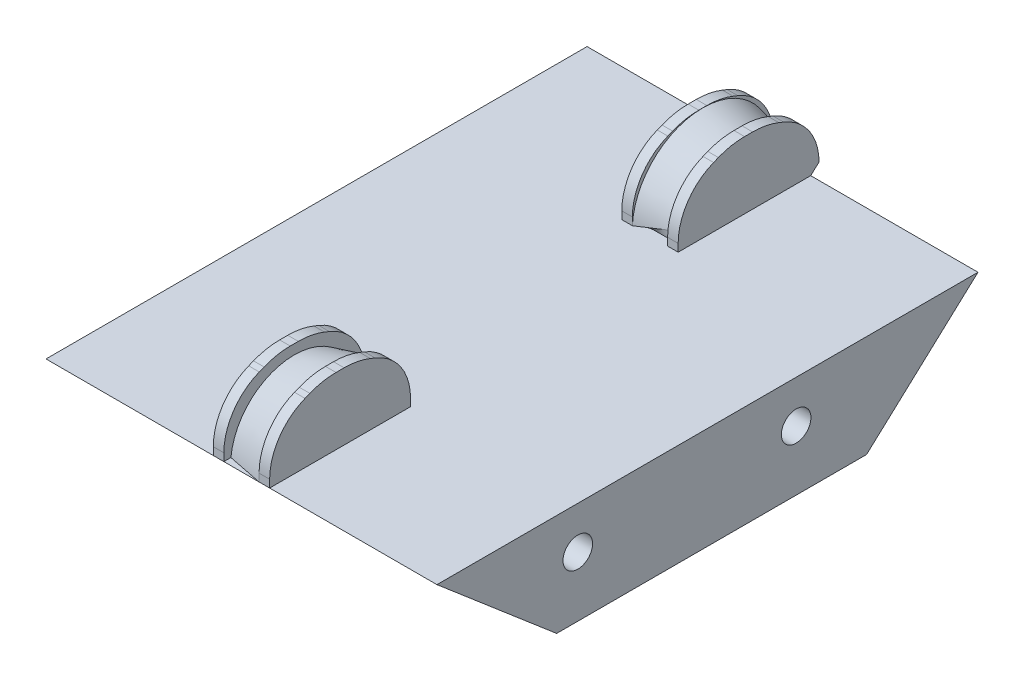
ISO-10303-21;
HEADER;
FILE_DESCRIPTION(('STEP AP214'),'2;1');
FILE_NAME('part.step','',(''),(''),'','','');
FILE_SCHEMA(('AUTOMOTIVE_DESIGN { 1 0 10303 214 1 1 1 1 }'));
ENDSEC;
DATA;
#1=APPLICATION_CONTEXT('core data for automotive mechanical design processes');
#2=APPLICATION_PROTOCOL_DEFINITION('international standard','automotive_design',2000,#1);
#3=PRODUCT_CONTEXT('',#1,'mechanical');
#4=PRODUCT('Part','Part','',(#3));
#5=PRODUCT_RELATED_PRODUCT_CATEGORY('part','',(#4));
#6=PRODUCT_DEFINITION_FORMATION('','',#4);
#7=PRODUCT_DEFINITION_CONTEXT('part definition',#1,'design');
#8=PRODUCT_DEFINITION('design','',#6,#7);
#9=PRODUCT_DEFINITION_SHAPE('','',#8);
#10=(LENGTH_UNIT() NAMED_UNIT(*) SI_UNIT(.MILLI.,.METRE.));
#11=(NAMED_UNIT(*) PLANE_ANGLE_UNIT() SI_UNIT($,.RADIAN.));
#12=(NAMED_UNIT(*) SI_UNIT($,.STERADIAN.) SOLID_ANGLE_UNIT());
#13=UNCERTAINTY_MEASURE_WITH_UNIT(LENGTH_MEASURE(1.E-05),#10,'distance_accuracy_value','');
#14=(GEOMETRIC_REPRESENTATION_CONTEXT(3) GLOBAL_UNCERTAINTY_ASSIGNED_CONTEXT((#13)) GLOBAL_UNIT_ASSIGNED_CONTEXT((#10,
#11,#12)) REPRESENTATION_CONTEXT('',''));
#15=CARTESIAN_POINT('',(0.,0.,0.));
#16=DIRECTION('',(0.,0.,1.));
#17=DIRECTION('',(1.,0.,0.));
#18=AXIS2_PLACEMENT_3D('',#15,#16,#17);
#19=CARTESIAN_POINT('',(4.,0.,0.));
#20=DIRECTION('',(0.,0.,-1.));
#21=DIRECTION('',(-1.,0.,0.));
#22=AXIS2_PLACEMENT_3D('',#19,#20,#21);
#23=PLANE('',#22);
#24=DIRECTION('',(0.,-1.,0.));
#25=VECTOR('',#24,1.);
#26=CARTESIAN_POINT('',(-4.,0.,0.));
#27=LINE('',#26,#25);
#28=CARTESIAN_POINT('',(-4.,3.58373630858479,0.));
#29=VERTEX_POINT('',#28);
#30=CARTESIAN_POINT('',(-4.,2.5,0.));
#31=VERTEX_POINT('',#30);
#32=EDGE_CURVE('E753',#29,#31,#27,.T.);
#33=ORIENTED_EDGE('',*,*,#32,.T.);
#34=DIRECTION('',(1.,0.,0.));
#35=VECTOR('',#34,1.);
#36=CARTESIAN_POINT('',(-27.75,2.5,0.));
#37=LINE('',#36,#35);
#38=CARTESIAN_POINT('',(-2.5,2.5,0.));
#39=VERTEX_POINT('',#38);
#40=EDGE_CURVE('E959',#31,#39,#37,.T.);
#41=ORIENTED_EDGE('',*,*,#40,.T.);
#42=DIRECTION('',(0.,-1.,0.));
#43=VECTOR('',#42,1.);
#44=CARTESIAN_POINT('',(-2.5,0.,0.));
#45=LINE('',#44,#43);
#46=CARTESIAN_POINT('',(-2.5,3.58373630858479,0.));
#47=VERTEX_POINT('',#46);
#48=EDGE_CURVE('E1087',#47,#39,#45,.T.);
#49=ORIENTED_EDGE('',*,*,#48,.F.);
#50=DIRECTION('',(1.,0.,0.));
#51=VECTOR('',#50,1.);
#52=CARTESIAN_POINT('',(-4.,3.58373630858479,0.));
#53=LINE('',#52,#51);
#54=EDGE_CURVE('E120',#47,#29,#53,.F.);
#55=ORIENTED_EDGE('',*,*,#54,.T.);
#56=EDGE_LOOP('',(#33,#41,#49,#55));
#57=FACE_BOUND('',#56,.T.);
#58=ADVANCED_FACE('F108',(#57),#23,.F.);
#59=CARTESIAN_POINT('',(-2.5,0.,0.));
#60=DIRECTION('',(-1.,0.,0.));
#61=DIRECTION('',(0.,0.,-1.));
#62=AXIS2_PLACEMENT_3D('',#59,#60,#61);
#63=PLANE('',#62);
#64=DIRECTION('',(0.,-1.,0.));
#65=VECTOR('',#64,1.);
#66=CARTESIAN_POINT('',(-2.5,0.,-58.));
#67=LINE('',#66,#65);
#68=CARTESIAN_POINT('',(-2.5,3.58373630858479,-58.));
#69=VERTEX_POINT('',#68);
#70=CARTESIAN_POINT('',(-2.5,2.5,-58.));
#71=VERTEX_POINT('',#70);
#72=EDGE_CURVE('E895',#69,#71,#67,.T.);
#73=ORIENTED_EDGE('',*,*,#72,.T.);
#74=CARTESIAN_POINT('',(-2.5,1.98684275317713,-68.));
#75=DIRECTION('',(1.,0.,0.));
#76=DIRECTION('',(0.,0.,1.));
#77=AXIS2_PLACEMENT_3D('',#74,#75,#76);
#78=CIRCLE('',#77,10.0131578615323);
#79=CARTESIAN_POINT('',(-2.5,11.9999285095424,-67.9229678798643));
#80=VERTEX_POINT('',#79);
#81=EDGE_CURVE('E567',#80,#71,#78,.T.);
#82=ORIENTED_EDGE('',*,*,#81,.F.);
#83=DIRECTION('',(0.,0.,1.));
#84=VECTOR('',#83,1.);
#85=CARTESIAN_POINT('',(-2.5,12.,-65.5));
#86=LINE('',#85,#84);
#87=CARTESIAN_POINT('',(-2.5,12.,-67.4258240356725));
#88=VERTEX_POINT('',#87);
#89=EDGE_CURVE('E743',#80,#88,#86,.T.);
#90=ORIENTED_EDGE('',*,*,#89,.T.);
#91=CARTESIAN_POINT('',(-2.5,2.,-67.4258240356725));
#92=DIRECTION('',(-1.,0.,0.));
#93=DIRECTION('',(0.,0.,1.));
#94=AXIS2_PLACEMENT_3D('',#91,#92,#93);
#95=CIRCLE('',#94,10.);
#96=CARTESIAN_POINT('',(-2.5,11.2847669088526,-63.7119172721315));
#97=VERTEX_POINT('',#96);
#98=EDGE_CURVE('E865',#88,#97,#95,.F.);
#99=ORIENTED_EDGE('',*,*,#98,.T.);
#100=DIRECTION('',(0.,-0.371390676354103,0.928476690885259));
#101=VECTOR('',#100,1.);
#102=CARTESIAN_POINT('',(-2.5,12.,-65.5));
#103=LINE('',#102,#101);
#104=CARTESIAN_POINT('',(-2.5,11.0115498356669,-63.0288745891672));
#105=VERTEX_POINT('',#104);
#106=EDGE_CURVE('E748',#97,#105,#103,.T.);
#107=ORIENTED_EDGE('',*,*,#106,.T.);
#108=CARTESIAN_POINT('',(-2.5,3.58373630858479,-66.));
#109=DIRECTION('',(-1.,0.,0.));
#110=DIRECTION('',(0.,0.,1.));
#111=AXIS2_PLACEMENT_3D('',#108,#109,#110);
#112=CIRCLE('',#111,8.);
#113=EDGE_CURVE('E812',#105,#69,#112,.F.);
#114=ORIENTED_EDGE('',*,*,#113,.T.);
#115=EDGE_LOOP('',(#73,#82,#90,#99,#107,#114));
#116=FACE_BOUND('',#115,.T.);
#117=ADVANCED_FACE('F914',(#116),#63,.F.);
#118=CARTESIAN_POINT('',(2.5,0.,0.));
#119=DIRECTION('',(1.,0.,0.));
#120=DIRECTION('',(0.,0.,-1.));
#121=AXIS2_PLACEMENT_3D('',#118,#119,#120);
#122=PLANE('',#121);
#123=DIRECTION('',(0.,1.,0.));
#124=VECTOR('',#123,1.);
#125=CARTESIAN_POINT('',(2.5,0.,-20.));
#126=LINE('',#125,#124);
#127=CARTESIAN_POINT('',(2.5,2.5,-20.));
#128=VERTEX_POINT('',#127);
#129=CARTESIAN_POINT('',(2.5,3.58373630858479,-20.));
#130=VERTEX_POINT('',#129);
#131=EDGE_CURVE('E492',#128,#130,#126,.T.);
#132=ORIENTED_EDGE('',*,*,#131,.F.);
#133=CARTESIAN_POINT('',(2.5,1.98684327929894,-10.));
#134=DIRECTION('',(1.,0.,0.));
#135=DIRECTION('',(0.,0.,1.));
#136=AXIS2_PLACEMENT_3D('',#133,#134,#135);
#137=CIRCLE('',#136,10.0131578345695);
#138=CARTESIAN_POINT('',(2.5,12.0000011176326,-9.99972297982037));
#139=VERTEX_POINT('',#138);
#140=EDGE_CURVE('E486',#128,#139,#137,.T.);
#141=ORIENTED_EDGE('',*,*,#140,.T.);
#142=DIRECTION('',(0.,0.,1.));
#143=VECTOR('',#142,1.);
#144=CARTESIAN_POINT('',(2.5,12.,-7.5));
#145=LINE('',#144,#143);
#146=CARTESIAN_POINT('',(2.5,12.,-10.5741759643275));
#147=VERTEX_POINT('',#146);
#148=EDGE_CURVE('E1287',#147,#139,#145,.T.);
#149=ORIENTED_EDGE('',*,*,#148,.F.);
#150=CARTESIAN_POINT('',(2.5,2.,-10.5741759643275));
#151=DIRECTION('',(1.,0.,0.));
#152=DIRECTION('',(0.,0.,-1.));
#153=AXIS2_PLACEMENT_3D('',#150,#151,#152);
#154=CIRCLE('',#153,10.);
#155=CARTESIAN_POINT('',(2.5,11.2847669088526,-14.2880827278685));
#156=VERTEX_POINT('',#155);
#157=EDGE_CURVE('E1944',#147,#156,#154,.F.);
#158=ORIENTED_EDGE('',*,*,#157,.T.);
#159=DIRECTION('',(0.,0.371390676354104,0.928476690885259));
#160=VECTOR('',#159,1.);
#161=CARTESIAN_POINT('',(2.5,12.,-12.5));
#162=LINE('',#161,#160);
#163=CARTESIAN_POINT('',(2.5,11.0115498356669,-14.9711254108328));
#164=VERTEX_POINT('',#163);
#165=EDGE_CURVE('E1209',#164,#156,#162,.T.);
#166=ORIENTED_EDGE('',*,*,#165,.F.);
#167=CARTESIAN_POINT('',(2.5,3.58373630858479,-12.));
#168=DIRECTION('',(1.,0.,0.));
#169=DIRECTION('',(0.,0.,-1.));
#170=AXIS2_PLACEMENT_3D('',#167,#168,#169);
#171=CIRCLE('',#170,8.);
#172=EDGE_CURVE('E1204',#164,#130,#171,.F.);
#173=ORIENTED_EDGE('',*,*,#172,.T.);
#174=EDGE_LOOP('',(#132,#141,#149,#158,#166,#173));
#175=FACE_BOUND('',#174,.T.);
#176=ADVANCED_FACE('F506',(#175),#122,.F.);
#177=CARTESIAN_POINT('',(27.75,2.5,0.));
#178=DIRECTION('',(0.,-1.,0.));
#179=DIRECTION('',(0.,0.,-1.));
#180=AXIS2_PLACEMENT_3D('',#177,#178,#179);
#181=PLANE('',#180);
#182=DIRECTION('',(0.,0.,1.));
#183=VECTOR('',#182,1.);
#184=CARTESIAN_POINT('',(27.75,2.5,0.));
#185=LINE('',#184,#183);
#186=CARTESIAN_POINT('',(27.75,2.49999999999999,-76.8177727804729));
#187=VERTEX_POINT('',#186);
#188=CARTESIAN_POINT('',(27.75,2.5,0.));
#189=VERTEX_POINT('',#188);
#190=EDGE_CURVE('E442',#187,#189,#185,.T.);
#191=ORIENTED_EDGE('',*,*,#190,.F.);
#192=DIRECTION('',(-1.,0.,0.));
#193=VECTOR('',#192,1.);
#194=CARTESIAN_POINT('',(27.75,2.5,-76.8177727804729));
#195=LINE('',#194,#193);
#196=CARTESIAN_POINT('',(4.,2.5,-76.8177727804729));
#197=VERTEX_POINT('',#196);
#198=EDGE_CURVE('E618',#187,#197,#195,.T.);
#199=ORIENTED_EDGE('',*,*,#198,.T.);
#200=DIRECTION('',(0.,0.,-1.));
#201=VECTOR('',#200,1.);
#202=CARTESIAN_POINT('',(4.,2.5,0.));
#203=LINE('',#202,#201);
#204=CARTESIAN_POINT('',(4.,2.5,-58.));
#205=VERTEX_POINT('',#204);
#206=EDGE_CURVE('E1218',#205,#197,#203,.T.);
#207=ORIENTED_EDGE('',*,*,#206,.F.);
#208=DIRECTION('',(-1.,0.,0.));
#209=VECTOR('',#208,1.);
#210=CARTESIAN_POINT('',(4.,2.5,-58.));
#211=LINE('',#210,#209);
#212=CARTESIAN_POINT('',(2.5,2.5,-58.));
#213=VERTEX_POINT('',#212);
#214=EDGE_CURVE('E1225',#205,#213,#211,.T.);
#215=ORIENTED_EDGE('',*,*,#214,.T.);
#216=DIRECTION('',(0.,0.,-1.));
#217=VECTOR('',#216,1.);
#218=CARTESIAN_POINT('',(2.5,2.5,0.));
#219=LINE('',#218,#217);
#220=CARTESIAN_POINT('',(2.5,2.5,-59.));
#221=VERTEX_POINT('',#220);
#222=EDGE_CURVE('E883',#213,#221,#219,.T.);
#223=ORIENTED_EDGE('',*,*,#222,.T.);
#224=CARTESIAN_POINT('',(-2.5,2.5,-59.));
#225=CARTESIAN_POINT('',(-0.833333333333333,2.5,-59.));
#226=CARTESIAN_POINT('',(0.833333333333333,2.5,-59.));
#227=CARTESIAN_POINT('',(2.5,2.5,-59.));
#228=B_SPLINE_CURVE_WITH_KNOTS('',3,(#224,#225,#226,#227),.UNSPECIFIED.,.F.,.F.,(4,4),(0.,1.),.UNSPECIFIED.);
#229=CARTESIAN_POINT('',(-2.5,2.5,-59.));
#230=VERTEX_POINT('',#229);
#231=EDGE_CURVE('E542',#221,#230,#228,.F.);
#232=ORIENTED_EDGE('',*,*,#231,.T.);
#233=CARTESIAN_POINT('',(-2.5,2.5,-58.));
#234=CARTESIAN_POINT('',(-2.5,2.5,-58.0833333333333));
#235=CARTESIAN_POINT('',(-2.5,2.5,-58.25));
#236=CARTESIAN_POINT('',(-2.5,2.5,-58.5));
#237=CARTESIAN_POINT('',(-2.5,2.5,-58.75));
#238=CARTESIAN_POINT('',(-2.5,2.5,-58.9166666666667));
#239=CARTESIAN_POINT('',(-2.5,2.5,-59.));
#240=B_SPLINE_CURVE_WITH_KNOTS('',3,(#233,#234,#235,#236,#237,#238,#239),.UNSPECIFIED.,.F.,.F.,
(4,1,1,1,4),(0.,0.00602484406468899,0.012049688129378,0.018074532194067,0.024099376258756),.UNSPECIFIED.);
#241=EDGE_CURVE('E1158',#71,#230,#240,.T.);
#242=ORIENTED_EDGE('',*,*,#241,.F.);
#243=DIRECTION('',(-1.,0.,0.));
#244=VECTOR('',#243,1.);
#245=CARTESIAN_POINT('',(27.75,2.5,-58.));
#246=LINE('',#245,#244);
#247=CARTESIAN_POINT('',(-4.,2.5,-58.));
#248=VERTEX_POINT('',#247);
#249=EDGE_CURVE('E878',#71,#248,#246,.T.);
#250=ORIENTED_EDGE('',*,*,#249,.T.);
#251=DIRECTION('',(0.,0.,-1.));
#252=VECTOR('',#251,1.);
#253=CARTESIAN_POINT('',(-4.,2.5,0.));
#254=LINE('',#253,#252);
#255=CARTESIAN_POINT('',(-4.,2.5,-76.8177727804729));
#256=VERTEX_POINT('',#255);
#257=EDGE_CURVE('E986',#248,#256,#254,.T.);
#258=ORIENTED_EDGE('',*,*,#257,.T.);
#259=CARTESIAN_POINT('',(-27.75,2.49999999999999,-76.8177727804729));
#260=VERTEX_POINT('',#259);
#261=EDGE_CURVE('E948',#256,#260,#195,.T.);
#262=ORIENTED_EDGE('',*,*,#261,.T.);
#263=DIRECTION('',(0.,0.,1.));
#264=VECTOR('',#263,1.);
#265=CARTESIAN_POINT('',(-27.75,2.5,0.));
#266=LINE('',#265,#264);
#267=CARTESIAN_POINT('',(-27.75,2.5,0.));
#268=VERTEX_POINT('',#267);
#269=EDGE_CURVE('E451',#260,#268,#266,.T.);
#270=ORIENTED_EDGE('',*,*,#269,.T.);
#271=DIRECTION('',(-1.,0.,0.));
#272=VECTOR('',#271,1.);
#273=CARTESIAN_POINT('',(27.75,2.5,0.));
#274=LINE('',#273,#272);
#275=EDGE_CURVE('E455',#31,#268,#274,.T.);
#276=ORIENTED_EDGE('',*,*,#275,.F.);
#277=CARTESIAN_POINT('',(-4.,2.5,-20.));
#278=VERTEX_POINT('',#277);
#279=EDGE_CURVE('E991',#31,#278,#254,.T.);
#280=ORIENTED_EDGE('',*,*,#279,.T.);
#281=DIRECTION('',(1.,0.,0.));
#282=VECTOR('',#281,1.);
#283=CARTESIAN_POINT('',(27.75,2.5,-20.));
#284=LINE('',#283,#282);
#285=CARTESIAN_POINT('',(-2.5,2.5,-20.));
#286=VERTEX_POINT('',#285);
#287=EDGE_CURVE('E873',#278,#286,#284,.T.);
#288=ORIENTED_EDGE('',*,*,#287,.T.);
#289=DIRECTION('',(0.,0.,-1.));
#290=VECTOR('',#289,1.);
#291=CARTESIAN_POINT('',(-2.5,2.5,0.));
#292=LINE('',#291,#290);
#293=CARTESIAN_POINT('',(-2.5,2.5,-19.));
#294=VERTEX_POINT('',#293);
#295=EDGE_CURVE('E760',#294,#286,#292,.T.);
#296=ORIENTED_EDGE('',*,*,#295,.F.);
#297=DIRECTION('',(-0.98058067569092,0.,0.196116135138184));
#298=VECTOR('',#297,1.);
#299=CARTESIAN_POINT('',(0.,2.5,-19.5));
#300=LINE('',#299,#298);
#301=EDGE_CURVE('E685',#128,#294,#300,.T.);
#302=ORIENTED_EDGE('',*,*,#301,.F.);
#303=DIRECTION('',(1.,0.,0.));
#304=VECTOR('',#303,1.);
#305=CARTESIAN_POINT('',(4.,2.5,-20.));
#306=LINE('',#305,#304);
#307=CARTESIAN_POINT('',(4.,2.5,-20.));
#308=VERTEX_POINT('',#307);
#309=EDGE_CURVE('E1213',#128,#308,#306,.T.);
#310=ORIENTED_EDGE('',*,*,#309,.T.);
#311=CARTESIAN_POINT('',(4.,2.5,0.));
#312=VERTEX_POINT('',#311);
#313=EDGE_CURVE('E1217',#312,#308,#203,.T.);
#314=ORIENTED_EDGE('',*,*,#313,.F.);
#315=EDGE_CURVE('E467',#189,#312,#274,.T.);
#316=ORIENTED_EDGE('',*,*,#315,.F.);
#317=EDGE_LOOP('',(#191,#199,#207,#215,#223,#232,#242,#250,#258,#262,#270,#276,#280,#288,#296,
#302,#310,#314,#316));
#318=FACE_BOUND('',#317,.T.);
#319=ADVANCED_FACE('F560',(#318),#181,.F.);
#320=CARTESIAN_POINT('',(4.,0.,-20.));
#321=DIRECTION('',(0.,0.,1.));
#322=DIRECTION('',(1.,0.,0.));
#323=AXIS2_PLACEMENT_3D('',#320,#321,#322);
#324=PLANE('',#323);
#325=ORIENTED_EDGE('',*,*,#309,.F.);
#326=ORIENTED_EDGE('',*,*,#131,.T.);
#327=DIRECTION('',(-1.,0.,0.));
#328=VECTOR('',#327,1.);
#329=CARTESIAN_POINT('',(4.,3.58373630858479,-20.));
#330=LINE('',#329,#328);
#331=CARTESIAN_POINT('',(4.,3.58373630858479,-20.));
#332=VERTEX_POINT('',#331);
#333=EDGE_CURVE('E1857',#130,#332,#330,.F.);
#334=ORIENTED_EDGE('',*,*,#333,.T.);
#335=DIRECTION('',(0.,1.,0.));
#336=VECTOR('',#335,1.);
#337=CARTESIAN_POINT('',(4.,0.,-20.));
#338=LINE('',#337,#336);
#339=EDGE_CURVE('E1214',#308,#332,#338,.T.);
#340=ORIENTED_EDGE('',*,*,#339,.F.);
#341=EDGE_LOOP('',(#325,#326,#334,#340));
#342=FACE_BOUND('',#341,.T.);
#343=ADVANCED_FACE('F1194',(#342),#324,.F.);
#344=CARTESIAN_POINT('',(4.,0.,0.));
#345=DIRECTION('',(1.,0.,0.));
#346=DIRECTION('',(0.,0.,-1.));
#347=AXIS2_PLACEMENT_3D('',#344,#345,#346);
#348=PLANE('',#347);
#349=DIRECTION('',(0.,-1.,0.));
#350=VECTOR('',#349,1.);
#351=CARTESIAN_POINT('',(4.,0.,0.));
#352=LINE('',#351,#350);
#353=CARTESIAN_POINT('',(4.,3.58373630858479,0.));
#354=VERTEX_POINT('',#353);
#355=EDGE_CURVE('E1081',#354,#312,#352,.T.);
#356=ORIENTED_EDGE('',*,*,#355,.T.);
#357=ORIENTED_EDGE('',*,*,#313,.T.);
#358=ORIENTED_EDGE('',*,*,#339,.T.);
#359=CARTESIAN_POINT('',(4.,3.58373630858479,-12.));
#360=DIRECTION('',(1.,0.,0.));
#361=DIRECTION('',(0.,0.,-1.));
#362=AXIS2_PLACEMENT_3D('',#359,#360,#361);
#363=CIRCLE('',#362,8.);
#364=CARTESIAN_POINT('',(4.,11.0115498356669,-14.9711254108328));
#365=VERTEX_POINT('',#364);
#366=EDGE_CURVE('E1877',#332,#365,#363,.T.);
#367=ORIENTED_EDGE('',*,*,#366,.T.);
#368=DIRECTION('',(0.,0.371390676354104,0.928476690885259));
#369=VECTOR('',#368,1.);
#370=CARTESIAN_POINT('',(4.,12.,-12.5));
#371=LINE('',#370,#369);
#372=CARTESIAN_POINT('',(4.,11.2847669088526,-14.2880827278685));
#373=VERTEX_POINT('',#372);
#374=EDGE_CURVE('E1254',#365,#373,#371,.T.);
#375=ORIENTED_EDGE('',*,*,#374,.T.);
#376=CARTESIAN_POINT('',(4.,2.,-10.5741759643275));
#377=DIRECTION('',(1.,0.,0.));
#378=DIRECTION('',(0.,0.,-1.));
#379=AXIS2_PLACEMENT_3D('',#376,#377,#378);
#380=CIRCLE('',#379,10.);
#381=CARTESIAN_POINT('',(4.,12.,-10.5741759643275));
#382=VERTEX_POINT('',#381);
#383=EDGE_CURVE('E1927',#373,#382,#380,.T.);
#384=ORIENTED_EDGE('',*,*,#383,.T.);
#385=DIRECTION('',(0.,0.,1.));
#386=VECTOR('',#385,1.);
#387=CARTESIAN_POINT('',(4.,12.,-7.5));
#388=LINE('',#387,#386);
#389=CARTESIAN_POINT('',(4.,12.,-9.42582403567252));
#390=VERTEX_POINT('',#389);
#391=EDGE_CURVE('E1257',#382,#390,#388,.T.);
#392=ORIENTED_EDGE('',*,*,#391,.T.);
#393=CARTESIAN_POINT('',(4.,2.,-9.42582403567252));
#394=DIRECTION('',(1.,0.,0.));
#395=DIRECTION('',(0.,0.,-1.));
#396=AXIS2_PLACEMENT_3D('',#393,#394,#395);
#397=CIRCLE('',#396,10.);
#398=CARTESIAN_POINT('',(4.,11.2847669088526,-5.71191727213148));
#399=VERTEX_POINT('',#398);
#400=EDGE_CURVE('E1930',#390,#399,#397,.T.);
#401=ORIENTED_EDGE('',*,*,#400,.T.);
#402=DIRECTION('',(0.,-0.371390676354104,0.928476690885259));
#403=VECTOR('',#402,1.);
#404=CARTESIAN_POINT('',(4.,12.,-7.5));
#405=LINE('',#404,#403);
#406=CARTESIAN_POINT('',(4.,11.0115498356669,-5.02887458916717));
#407=VERTEX_POINT('',#406);
#408=EDGE_CURVE('E1261',#399,#407,#405,.T.);
#409=ORIENTED_EDGE('',*,*,#408,.T.);
#410=CARTESIAN_POINT('',(4.,3.58373630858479,-8.));
#411=DIRECTION('',(1.,0.,0.));
#412=DIRECTION('',(0.,0.,-1.));
#413=AXIS2_PLACEMENT_3D('',#410,#411,#412);
#414=CIRCLE('',#413,8.);
#415=EDGE_CURVE('E1880',#407,#354,#414,.T.);
#416=ORIENTED_EDGE('',*,*,#415,.T.);
#417=EDGE_LOOP('',(#356,#357,#358,#367,#375,#384,#392,#401,#409,#416));
#418=FACE_BOUND('',#417,.T.);
#419=ADVANCED_FACE('F1187',(#418),#348,.T.);
#420=CARTESIAN_POINT('',(2.5,12.,-9.42582403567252));
#421=VERTEX_POINT('',#420);
#422=EDGE_CURVE('E1281',#139,#421,#145,.T.);
#423=ORIENTED_EDGE('',*,*,#422,.F.);
#424=CARTESIAN_POINT('',(2.5,2.5,0.));
#425=VERTEX_POINT('',#424);
#426=EDGE_CURVE('E112',#139,#425,#137,.T.);
#427=ORIENTED_EDGE('',*,*,#426,.T.);
#428=DIRECTION('',(0.,-1.,0.));
#429=VECTOR('',#428,1.);
#430=CARTESIAN_POINT('',(2.5,0.,0.));
#431=LINE('',#430,#429);
#432=CARTESIAN_POINT('',(2.5,3.58373630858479,0.));
#433=VERTEX_POINT('',#432);
#434=EDGE_CURVE('E1072',#433,#425,#431,.T.);
#435=ORIENTED_EDGE('',*,*,#434,.F.);
#436=CARTESIAN_POINT('',(2.5,3.58373630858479,-8.));
#437=DIRECTION('',(1.,0.,0.));
#438=DIRECTION('',(0.,0.,-1.));
#439=AXIS2_PLACEMENT_3D('',#436,#437,#438);
#440=CIRCLE('',#439,8.);
#441=CARTESIAN_POINT('',(2.5,11.0115498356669,-5.02887458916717));
#442=VERTEX_POINT('',#441);
#443=EDGE_CURVE('E1895',#433,#442,#440,.F.);
#444=ORIENTED_EDGE('',*,*,#443,.T.);
#445=DIRECTION('',(0.,-0.371390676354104,0.928476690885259));
#446=VECTOR('',#445,1.);
#447=CARTESIAN_POINT('',(2.5,12.,-7.5));
#448=LINE('',#447,#446);
#449=CARTESIAN_POINT('',(2.5,11.2847669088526,-5.71191727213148));
#450=VERTEX_POINT('',#449);
#451=EDGE_CURVE('E1082',#450,#442,#448,.T.);
#452=ORIENTED_EDGE('',*,*,#451,.F.);
#453=CARTESIAN_POINT('',(2.5,2.,-9.42582403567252));
#454=DIRECTION('',(1.,0.,0.));
#455=DIRECTION('',(0.,0.,-1.));
#456=AXIS2_PLACEMENT_3D('',#453,#454,#455);
#457=CIRCLE('',#456,10.);
#458=EDGE_CURVE('E1948',#450,#421,#457,.F.);
#459=ORIENTED_EDGE('',*,*,#458,.T.);
#460=EDGE_LOOP('',(#423,#427,#435,#444,#452,#459));
#461=FACE_BOUND('',#460,.T.);
#462=ADVANCED_FACE('F1181',(#461),#122,.F.);
#463=CARTESIAN_POINT('',(4.,12.,-12.5));
#464=DIRECTION('',(0.,-0.928476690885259,0.371390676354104));
#465=DIRECTION('',(0.,-0.371390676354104,-0.928476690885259));
#466=AXIS2_PLACEMENT_3D('',#463,#464,#465);
#467=PLANE('',#466);
#468=ORIENTED_EDGE('',*,*,#374,.F.);
#469=DIRECTION('',(-1.,0.,0.));
#470=VECTOR('',#469,1.);
#471=CARTESIAN_POINT('',(4.,11.0115498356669,-14.9711254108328));
#472=LINE('',#471,#470);
#473=EDGE_CURVE('E1860',#365,#164,#472,.T.);
#474=ORIENTED_EDGE('',*,*,#473,.T.);
#475=ORIENTED_EDGE('',*,*,#165,.T.);
#476=DIRECTION('',(-1.,0.,0.));
#477=VECTOR('',#476,1.);
#478=CARTESIAN_POINT('',(4.,11.2847669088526,-14.2880827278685));
#479=LINE('',#478,#477);
#480=EDGE_CURVE('E1906',#156,#373,#479,.F.);
#481=ORIENTED_EDGE('',*,*,#480,.T.);
#482=EDGE_LOOP('',(#468,#474,#475,#481));
#483=FACE_BOUND('',#482,.T.);
#484=ADVANCED_FACE('F1186',(#483),#467,.F.);
#485=CARTESIAN_POINT('',(4.,12.,-7.5));
#486=DIRECTION('',(0.,-1.,0.));
#487=DIRECTION('',(0.,0.,-1.));
#488=AXIS2_PLACEMENT_3D('',#485,#486,#487);
#489=PLANE('',#488);
#490=ORIENTED_EDGE('',*,*,#391,.F.);
#491=DIRECTION('',(-1.,0.,0.));
#492=VECTOR('',#491,1.);
#493=CARTESIAN_POINT('',(4.,12.,-10.5741759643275));
#494=LINE('',#493,#492);
#495=EDGE_CURVE('E1910',#382,#147,#494,.T.);
#496=ORIENTED_EDGE('',*,*,#495,.T.);
#497=ORIENTED_EDGE('',*,*,#148,.T.);
#498=ORIENTED_EDGE('',*,*,#422,.T.);
#499=DIRECTION('',(-1.,0.,0.));
#500=VECTOR('',#499,1.);
#501=CARTESIAN_POINT('',(4.,12.,-9.42582403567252));
#502=LINE('',#501,#500);
#503=EDGE_CURVE('E1914',#421,#390,#502,.F.);
#504=ORIENTED_EDGE('',*,*,#503,.T.);
#505=EDGE_LOOP('',(#490,#496,#497,#498,#504));
#506=FACE_BOUND('',#505,.T.);
#507=ADVANCED_FACE('F1067',(#506),#489,.F.);
#508=CARTESIAN_POINT('',(4.,12.,-7.5));
#509=DIRECTION('',(0.,-0.928476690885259,-0.371390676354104));
#510=DIRECTION('',(0.,0.371390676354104,-0.928476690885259));
#511=AXIS2_PLACEMENT_3D('',#508,#509,#510);
#512=PLANE('',#511);
#513=ORIENTED_EDGE('',*,*,#451,.T.);
#514=DIRECTION('',(-1.,0.,0.));
#515=VECTOR('',#514,1.);
#516=CARTESIAN_POINT('',(4.,11.0115498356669,-5.02887458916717));
#517=LINE('',#516,#515);
#518=EDGE_CURVE('E886',#442,#407,#517,.F.);
#519=ORIENTED_EDGE('',*,*,#518,.T.);
#520=ORIENTED_EDGE('',*,*,#408,.F.);
#521=DIRECTION('',(-1.,0.,0.));
#522=VECTOR('',#521,1.);
#523=CARTESIAN_POINT('',(4.,11.2847669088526,-5.71191727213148));
#524=LINE('',#523,#522);
#525=EDGE_CURVE('E1902',#399,#450,#524,.T.);
#526=ORIENTED_EDGE('',*,*,#525,.T.);
#527=EDGE_LOOP('',(#513,#519,#520,#526));
#528=FACE_BOUND('',#527,.T.);
#529=ADVANCED_FACE('F1056',(#528),#512,.F.);
#530=ORIENTED_EDGE('',*,*,#434,.T.);
#531=EDGE_CURVE('E433',#425,#312,#37,.T.);
#532=ORIENTED_EDGE('',*,*,#531,.T.);
#533=ORIENTED_EDGE('',*,*,#355,.F.);
#534=DIRECTION('',(-1.,0.,0.));
#535=VECTOR('',#534,1.);
#536=CARTESIAN_POINT('',(4.,3.58373630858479,0.));
#537=LINE('',#536,#535);
#538=EDGE_CURVE('E1077',#354,#433,#537,.T.);
#539=ORIENTED_EDGE('',*,*,#538,.T.);
#540=EDGE_LOOP('',(#530,#532,#533,#539));
#541=FACE_BOUND('',#540,.T.);
#542=ADVANCED_FACE('F509',(#541),#23,.F.);
#543=CARTESIAN_POINT('',(4.,2.,-10.5741759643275));
#544=DIRECTION('',(-1.,0.,0.));
#545=DIRECTION('',(0.,0.,1.));
#546=AXIS2_PLACEMENT_3D('',#543,#544,#545);
#547=CYLINDRICAL_SURFACE('',#546,10.);
#548=ORIENTED_EDGE('',*,*,#383,.F.);
#549=ORIENTED_EDGE('',*,*,#480,.F.);
#550=ORIENTED_EDGE('',*,*,#157,.F.);
#551=ORIENTED_EDGE('',*,*,#495,.F.);
#552=EDGE_LOOP('',(#548,#549,#550,#551));
#553=FACE_BOUND('',#552,.T.);
#554=ADVANCED_FACE('F1055',(#553),#547,.T.);
#555=CARTESIAN_POINT('',(4.,2.,-9.42582403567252));
#556=DIRECTION('',(-1.,0.,0.));
#557=DIRECTION('',(0.,0.,1.));
#558=AXIS2_PLACEMENT_3D('',#555,#556,#557);
#559=CYLINDRICAL_SURFACE('',#558,10.);
#560=ORIENTED_EDGE('',*,*,#400,.F.);
#561=ORIENTED_EDGE('',*,*,#503,.F.);
#562=ORIENTED_EDGE('',*,*,#458,.F.);
#563=ORIENTED_EDGE('',*,*,#525,.F.);
#564=EDGE_LOOP('',(#560,#561,#562,#563));
#565=FACE_BOUND('',#564,.T.);
#566=ADVANCED_FACE('F1063',(#565),#559,.T.);
#567=CARTESIAN_POINT('',(4.,3.58373630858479,-12.));
#568=DIRECTION('',(-1.,0.,0.));
#569=DIRECTION('',(0.,0.,1.));
#570=AXIS2_PLACEMENT_3D('',#567,#568,#569);
#571=CYLINDRICAL_SURFACE('',#570,8.);
#572=ORIENTED_EDGE('',*,*,#366,.F.);
#573=ORIENTED_EDGE('',*,*,#333,.F.);
#574=ORIENTED_EDGE('',*,*,#172,.F.);
#575=ORIENTED_EDGE('',*,*,#473,.F.);
#576=EDGE_LOOP('',(#572,#573,#574,#575));
#577=FACE_BOUND('',#576,.T.);
#578=ADVANCED_FACE('F1035',(#577),#571,.T.);
#579=CARTESIAN_POINT('',(4.,3.58373630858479,-8.));
#580=DIRECTION('',(-1.,0.,0.));
#581=DIRECTION('',(0.,0.,1.));
#582=AXIS2_PLACEMENT_3D('',#579,#580,#581);
#583=CYLINDRICAL_SURFACE('',#582,8.);
#584=ORIENTED_EDGE('',*,*,#415,.F.);
#585=ORIENTED_EDGE('',*,*,#518,.F.);
#586=ORIENTED_EDGE('',*,*,#443,.F.);
#587=ORIENTED_EDGE('',*,*,#538,.F.);
#588=EDGE_LOOP('',(#584,#585,#586,#587));
#589=FACE_BOUND('',#588,.T.);
#590=ADVANCED_FACE('F1023',(#589),#583,.T.);
#591=CARTESIAN_POINT('',(27.75,-3.5,-20.));
#592=DIRECTION('',(-1.,0.,0.));
#593=DIRECTION('',(0.,0.,1.));
#594=AXIS2_PLACEMENT_3D('',#591,#592,#593);
#595=CYLINDRICAL_SURFACE('',#594,2.1);
#596=CARTESIAN_POINT('',(-4.,-3.5,-20.));
#597=DIRECTION('',(-1.,0.,0.));
#598=DIRECTION('',(0.,0.,1.));
#599=AXIS2_PLACEMENT_3D('',#596,#597,#598);
#600=CIRCLE('',#599,2.1);
#601=CARTESIAN_POINT('',(-4.,-3.5,-17.9));
#602=VERTEX_POINT('',#601);
#603=EDGE_CURVE('E872',#602,#602,#600,.T.);
#604=ORIENTED_EDGE('',*,*,#603,.F.);
#605=EDGE_LOOP('',(#604));
#606=FACE_BOUND('',#605,.T.);
#607=CARTESIAN_POINT('',(-27.75,-3.5,-20.));
#608=DIRECTION('',(1.,0.,0.));
#609=DIRECTION('',(0.,0.,-1.));
#610=AXIS2_PLACEMENT_3D('',#607,#608,#609);
#611=CIRCLE('',#610,2.1);
#612=CARTESIAN_POINT('',(-27.75,-3.5,-22.1));
#613=VERTEX_POINT('',#612);
#614=EDGE_CURVE('E461',#613,#613,#611,.T.);
#615=ORIENTED_EDGE('',*,*,#614,.F.);
#616=EDGE_LOOP('',(#615));
#617=FACE_BOUND('',#616,.T.);
#618=ADVANCED_FACE('F1020',(#606,#617),#595,.F.);
#619=CARTESIAN_POINT('',(27.75,-3.5,-51.));
#620=DIRECTION('',(-1.,0.,0.));
#621=DIRECTION('',(0.,0.,1.));
#622=AXIS2_PLACEMENT_3D('',#619,#620,#621);
#623=CYLINDRICAL_SURFACE('',#622,2.1);
#624=CARTESIAN_POINT('',(-4.,-3.5,-51.));
#625=DIRECTION('',(-1.,0.,0.));
#626=DIRECTION('',(0.,0.,1.));
#627=AXIS2_PLACEMENT_3D('',#624,#625,#626);
#628=CIRCLE('',#627,2.1);
#629=CARTESIAN_POINT('',(-4.,-3.5,-48.9));
#630=VERTEX_POINT('',#629);
#631=EDGE_CURVE('E877',#630,#630,#628,.T.);
#632=ORIENTED_EDGE('',*,*,#631,.F.);
#633=EDGE_LOOP('',(#632));
#634=FACE_BOUND('',#633,.T.);
#635=CARTESIAN_POINT('',(-27.75,-3.5,-51.));
#636=DIRECTION('',(1.,0.,0.));
#637=DIRECTION('',(0.,0.,-1.));
#638=AXIS2_PLACEMENT_3D('',#635,#636,#637);
#639=CIRCLE('',#638,2.1);
#640=CARTESIAN_POINT('',(-27.75,-3.5,-53.1));
#641=VERTEX_POINT('',#640);
#642=EDGE_CURVE('E996',#641,#641,#639,.T.);
#643=ORIENTED_EDGE('',*,*,#642,.F.);
#644=EDGE_LOOP('',(#643));
#645=FACE_BOUND('',#644,.T.);
#646=ADVANCED_FACE('F1022',(#634,#645),#623,.F.);
#647=CARTESIAN_POINT('',(27.75,0.,0.));
#648=DIRECTION('',(-1.,0.,0.));
#649=DIRECTION('',(0.,0.,1.));
#650=AXIS2_PLACEMENT_3D('',#647,#648,#649);
#651=PLANE('',#650);
#652=ORIENTED_EDGE('',*,*,#190,.T.);
#653=DIRECTION('',(0.,0.64894660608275,0.760833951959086));
#654=VECTOR('',#653,1.);
#655=CARTESIAN_POINT('',(27.75,2.5,0.));
#656=LINE('',#655,#654);
#657=CARTESIAN_POINT('',(27.75,-12.,-17.));
#658=VERTEX_POINT('',#657);
#659=EDGE_CURVE('E424',#658,#189,#656,.T.);
#660=ORIENTED_EDGE('',*,*,#659,.F.);
#661=DIRECTION('',(0.,0.,-1.));
#662=VECTOR('',#661,1.);
#663=CARTESIAN_POINT('',(27.75,-12.,0.));
#664=LINE('',#663,#662);
#665=CARTESIAN_POINT('',(27.75,-12.,-61.));
#666=VERTEX_POINT('',#665);
#667=EDGE_CURVE('E440',#658,#666,#664,.T.);
#668=ORIENTED_EDGE('',*,*,#667,.T.);
#669=DIRECTION('',(0.,-0.675734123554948,0.737145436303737));
#670=VECTOR('',#669,1.);
#671=CARTESIAN_POINT('',(27.75,3.58373630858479,-78.));
#672=LINE('',#671,#670);
#673=EDGE_CURVE('E445',#187,#666,#672,.T.);
#674=ORIENTED_EDGE('',*,*,#673,.F.);
#675=EDGE_LOOP('',(#652,#660,#668,#674));
#676=FACE_BOUND('',#675,.T.);
#677=CARTESIAN_POINT('',(27.75,-3.5,-20.));
#678=DIRECTION('',(1.,0.,0.));
#679=DIRECTION('',(0.,0.,-1.));
#680=AXIS2_PLACEMENT_3D('',#677,#678,#679);
#681=CIRCLE('',#680,2.1);
#682=CARTESIAN_POINT('',(27.75,-3.5,-22.1));
#683=VERTEX_POINT('',#682);
#684=EDGE_CURVE('E465',#683,#683,#681,.T.);
#685=ORIENTED_EDGE('',*,*,#684,.F.);
#686=EDGE_LOOP('',(#685));
#687=FACE_BOUND('',#686,.T.);
#688=CARTESIAN_POINT('',(27.75,-3.5,-51.));
#689=DIRECTION('',(1.,0.,0.));
#690=DIRECTION('',(0.,0.,-1.));
#691=AXIS2_PLACEMENT_3D('',#688,#689,#690);
#692=CIRCLE('',#691,2.1);
#693=CARTESIAN_POINT('',(27.75,-3.5,-53.1));
#694=VERTEX_POINT('',#693);
#695=EDGE_CURVE('E1005',#694,#694,#692,.T.);
#696=ORIENTED_EDGE('',*,*,#695,.F.);
#697=EDGE_LOOP('',(#696));
#698=FACE_BOUND('',#697,.T.);
#699=ADVANCED_FACE('F437',(#676,#687,#698),#651,.F.);
#700=CARTESIAN_POINT('',(-27.75,0.,0.));
#701=DIRECTION('',(-1.,0.,0.));
#702=DIRECTION('',(0.,0.,1.));
#703=AXIS2_PLACEMENT_3D('',#700,#701,#702);
#704=PLANE('',#703);
#705=DIRECTION('',(0.,0.64894660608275,0.760833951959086));
#706=VECTOR('',#705,1.);
#707=CARTESIAN_POINT('',(-27.75,2.5,0.));
#708=LINE('',#707,#706);
#709=CARTESIAN_POINT('',(-27.75,-12.,-17.));
#710=VERTEX_POINT('',#709);
#711=EDGE_CURVE('E427',#710,#268,#708,.T.);
#712=ORIENTED_EDGE('',*,*,#711,.T.);
#713=ORIENTED_EDGE('',*,*,#269,.F.);
#714=DIRECTION('',(0.,-0.675734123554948,0.737145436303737));
#715=VECTOR('',#714,1.);
#716=CARTESIAN_POINT('',(-27.75,3.58373630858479,-78.));
#717=LINE('',#716,#715);
#718=CARTESIAN_POINT('',(-27.75,-12.,-61.));
#719=VERTEX_POINT('',#718);
#720=EDGE_CURVE('E968',#260,#719,#717,.T.);
#721=ORIENTED_EDGE('',*,*,#720,.T.);
#722=DIRECTION('',(0.,0.,-1.));
#723=VECTOR('',#722,1.);
#724=CARTESIAN_POINT('',(-27.75,-12.,0.));
#725=LINE('',#724,#723);
#726=EDGE_CURVE('E458',#710,#719,#725,.T.);
#727=ORIENTED_EDGE('',*,*,#726,.F.);
#728=EDGE_LOOP('',(#712,#713,#721,#727));
#729=FACE_BOUND('',#728,.T.);
#730=ORIENTED_EDGE('',*,*,#614,.T.);
#731=EDGE_LOOP('',(#730));
#732=FACE_BOUND('',#731,.T.);
#733=ORIENTED_EDGE('',*,*,#642,.T.);
#734=EDGE_LOOP('',(#733));
#735=FACE_BOUND('',#734,.T.);
#736=ADVANCED_FACE('F561',(#729,#732,#735),#704,.T.);
#737=CARTESIAN_POINT('',(27.75,-12.,0.));
#738=DIRECTION('',(0.,1.,0.));
#739=DIRECTION('',(0.,0.,1.));
#740=AXIS2_PLACEMENT_3D('',#737,#738,#739);
#741=PLANE('',#740);
#742=ORIENTED_EDGE('',*,*,#667,.F.);
#743=DIRECTION('',(1.,0.,0.));
#744=VECTOR('',#743,1.);
#745=CARTESIAN_POINT('',(-27.75,-12.,-17.));
#746=LINE('',#745,#744);
#747=EDGE_CURVE('E421',#710,#658,#746,.T.);
#748=ORIENTED_EDGE('',*,*,#747,.F.);
#749=ORIENTED_EDGE('',*,*,#726,.T.);
#750=DIRECTION('',(1.,0.,0.));
#751=VECTOR('',#750,1.);
#752=CARTESIAN_POINT('',(-27.75,-12.,-61.));
#753=LINE('',#752,#751);
#754=EDGE_CURVE('E449',#719,#666,#753,.T.);
#755=ORIENTED_EDGE('',*,*,#754,.T.);
#756=EDGE_LOOP('',(#742,#748,#749,#755));
#757=FACE_BOUND('',#756,.T.);
#758=ADVANCED_FACE('F448',(#757),#741,.F.);
#759=EDGE_CURVE('E472',#425,#39,#274,.T.);
#760=ORIENTED_EDGE('',*,*,#759,.F.);
#761=DIRECTION('',(0.98058067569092,0.,0.196116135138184));
#762=VECTOR('',#761,1.);
#763=CARTESIAN_POINT('',(0.,2.5,-0.499999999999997));
#764=LINE('',#763,#762);
#765=CARTESIAN_POINT('',(-2.5,2.5,-0.999999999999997));
#766=VERTEX_POINT('',#765);
#767=EDGE_CURVE('E681',#766,#425,#764,.T.);
#768=ORIENTED_EDGE('',*,*,#767,.F.);
#769=EDGE_CURVE('E763',#39,#766,#292,.T.);
#770=ORIENTED_EDGE('',*,*,#769,.F.);
#771=EDGE_LOOP('',(#760,#768,#770));
#772=FACE_BOUND('',#771,.T.);
#773=ADVANCED_FACE('F549',(#772),#181,.F.);
#774=CARTESIAN_POINT('',(4.,-3.5,-20.));
#775=DIRECTION('',(1.,0.,0.));
#776=DIRECTION('',(0.,0.,-1.));
#777=AXIS2_PLACEMENT_3D('',#774,#775,#776);
#778=CIRCLE('',#777,2.1);
#779=CARTESIAN_POINT('',(4.,-3.5,-22.1));
#780=VERTEX_POINT('',#779);
#781=EDGE_CURVE('E892',#780,#780,#778,.F.);
#782=ORIENTED_EDGE('',*,*,#781,.T.);
#783=EDGE_LOOP('',(#782));
#784=FACE_BOUND('',#783,.T.);
#785=ORIENTED_EDGE('',*,*,#684,.T.);
#786=EDGE_LOOP('',(#785));
#787=FACE_BOUND('',#786,.T.);
#788=ADVANCED_FACE('F558',(#784,#787),#595,.F.);
#789=CARTESIAN_POINT('',(4.,-3.5,-51.));
#790=DIRECTION('',(1.,0.,0.));
#791=DIRECTION('',(0.,0.,-1.));
#792=AXIS2_PLACEMENT_3D('',#789,#790,#791);
#793=CIRCLE('',#792,2.1);
#794=CARTESIAN_POINT('',(4.,-3.5,-53.1));
#795=VERTEX_POINT('',#794);
#796=EDGE_CURVE('E473',#795,#795,#793,.F.);
#797=ORIENTED_EDGE('',*,*,#796,.T.);
#798=EDGE_LOOP('',(#797));
#799=FACE_BOUND('',#798,.T.);
#800=ORIENTED_EDGE('',*,*,#695,.T.);
#801=EDGE_LOOP('',(#800));
#802=FACE_BOUND('',#801,.T.);
#803=ADVANCED_FACE('F1033',(#799,#802),#623,.F.);
#804=CARTESIAN_POINT('',(4.,3.58373630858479,-70.));
#805=DIRECTION('',(-1.,0.,0.));
#806=DIRECTION('',(0.,0.,1.));
#807=AXIS2_PLACEMENT_3D('',#804,#805,#806);
#808=CYLINDRICAL_SURFACE('',#807,8.);
#809=CARTESIAN_POINT('',(4.,3.58373630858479,-70.));
#810=DIRECTION('',(1.,0.,0.));
#811=DIRECTION('',(0.,0.,-1.));
#812=AXIS2_PLACEMENT_3D('',#809,#810,#811);
#813=CIRCLE('',#812,8.);
#814=CARTESIAN_POINT('',(4.,3.58373630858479,-78.));
#815=VERTEX_POINT('',#814);
#816=CARTESIAN_POINT('',(4.,11.0115498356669,-72.9711254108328));
#817=VERTEX_POINT('',#816);
#818=EDGE_CURVE('E1871',#815,#817,#813,.T.);
#819=ORIENTED_EDGE('',*,*,#818,.F.);
#820=DIRECTION('',(-1.,0.,0.));
#821=VECTOR('',#820,1.);
#822=CARTESIAN_POINT('',(4.,3.58373630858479,-78.));
#823=LINE('',#822,#821);
#824=CARTESIAN_POINT('',(2.5,3.58373630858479,-78.));
#825=VERTEX_POINT('',#824);
#826=EDGE_CURVE('E1883',#825,#815,#823,.F.);
#827=ORIENTED_EDGE('',*,*,#826,.F.);
#828=CARTESIAN_POINT('',(2.5,3.58373630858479,-70.));
#829=DIRECTION('',(1.,0.,0.));
#830=DIRECTION('',(0.,0.,-1.));
#831=AXIS2_PLACEMENT_3D('',#828,#829,#830);
#832=CIRCLE('',#831,8.);
#833=CARTESIAN_POINT('',(2.5,11.0115498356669,-72.9711254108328));
#834=VERTEX_POINT('',#833);
#835=EDGE_CURVE('E1886',#834,#825,#832,.F.);
#836=ORIENTED_EDGE('',*,*,#835,.F.);
#837=DIRECTION('',(-1.,0.,0.));
#838=VECTOR('',#837,1.);
#839=CARTESIAN_POINT('',(4.,11.0115498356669,-72.9711254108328));
#840=LINE('',#839,#838);
#841=EDGE_CURVE('E1898',#817,#834,#840,.T.);
#842=ORIENTED_EDGE('',*,*,#841,.F.);
#843=EDGE_LOOP('',(#819,#827,#836,#842));
#844=FACE_BOUND('',#843,.T.);
#845=ADVANCED_FACE('F1176',(#844),#808,.T.);
#846=CARTESIAN_POINT('',(4.,12.,-70.5));
#847=DIRECTION('',(0.,-0.928476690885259,0.371390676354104));
#848=DIRECTION('',(0.,-0.371390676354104,-0.928476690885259));
#849=AXIS2_PLACEMENT_3D('',#846,#847,#848);
#850=PLANE('',#849);
#851=DIRECTION('',(0.,0.371390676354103,0.928476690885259));
#852=VECTOR('',#851,1.);
#853=CARTESIAN_POINT('',(4.,12.,-70.5));
#854=LINE('',#853,#852);
#855=CARTESIAN_POINT('',(4.,11.2847669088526,-72.2880827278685));
#856=VERTEX_POINT('',#855);
#857=EDGE_CURVE('E1238',#817,#856,#854,.T.);
#858=ORIENTED_EDGE('',*,*,#857,.F.);
#859=ORIENTED_EDGE('',*,*,#841,.T.);
#860=DIRECTION('',(0.,0.371390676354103,0.928476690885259));
#861=VECTOR('',#860,1.);
#862=CARTESIAN_POINT('',(2.5,12.,-70.5));
#863=LINE('',#862,#861);
#864=CARTESIAN_POINT('',(2.5,11.2847669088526,-72.2880827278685));
#865=VERTEX_POINT('',#864);
#866=EDGE_CURVE('E1222',#834,#865,#863,.T.);
#867=ORIENTED_EDGE('',*,*,#866,.T.);
#868=DIRECTION('',(-1.,0.,0.));
#869=VECTOR('',#868,1.);
#870=CARTESIAN_POINT('',(4.,11.2847669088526,-72.2880827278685));
#871=LINE('',#870,#869);
#872=EDGE_CURVE('E1933',#865,#856,#871,.F.);
#873=ORIENTED_EDGE('',*,*,#872,.T.);
#874=EDGE_LOOP('',(#858,#859,#867,#873));
#875=FACE_BOUND('',#874,.T.);
#876=ADVANCED_FACE('F1722',(#875),#850,.F.);
#877=CARTESIAN_POINT('',(4.,2.,-68.5741759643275));
#878=DIRECTION('',(-1.,0.,0.));
#879=DIRECTION('',(0.,0.,1.));
#880=AXIS2_PLACEMENT_3D('',#877,#878,#879);
#881=CYLINDRICAL_SURFACE('',#880,10.);
#882=CARTESIAN_POINT('',(4.,2.,-68.5741759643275));
#883=DIRECTION('',(1.,0.,0.));
#884=DIRECTION('',(0.,0.,-1.));
#885=AXIS2_PLACEMENT_3D('',#882,#883,#884);
#886=CIRCLE('',#885,10.);
#887=CARTESIAN_POINT('',(4.,12.,-68.5741759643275));
#888=VERTEX_POINT('',#887);
#889=EDGE_CURVE('E1921',#856,#888,#886,.T.);
#890=ORIENTED_EDGE('',*,*,#889,.F.);
#891=ORIENTED_EDGE('',*,*,#872,.F.);
#892=CARTESIAN_POINT('',(2.5,2.,-68.5741759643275));
#893=DIRECTION('',(1.,0.,0.));
#894=DIRECTION('',(0.,0.,-1.));
#895=AXIS2_PLACEMENT_3D('',#892,#893,#894);
#896=CIRCLE('',#895,10.);
#897=CARTESIAN_POINT('',(2.5,12.,-68.5741759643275));
#898=VERTEX_POINT('',#897);
#899=EDGE_CURVE('E1937',#898,#865,#896,.F.);
#900=ORIENTED_EDGE('',*,*,#899,.F.);
#901=DIRECTION('',(-1.,0.,0.));
#902=VECTOR('',#901,1.);
#903=CARTESIAN_POINT('',(4.,12.,-68.5741759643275));
#904=LINE('',#903,#902);
#905=EDGE_CURVE('E1951',#888,#898,#904,.T.);
#906=ORIENTED_EDGE('',*,*,#905,.F.);
#907=EDGE_LOOP('',(#890,#891,#900,#906));
#908=FACE_BOUND('',#907,.T.);
#909=ADVANCED_FACE('F1726',(#908),#881,.T.);
#910=CARTESIAN_POINT('',(4.,12.,-65.5));
#911=DIRECTION('',(0.,-1.,0.));
#912=DIRECTION('',(0.,0.,-1.));
#913=AXIS2_PLACEMENT_3D('',#910,#911,#912);
#914=PLANE('',#913);
#915=DIRECTION('',(0.,0.,1.));
#916=VECTOR('',#915,1.);
#917=CARTESIAN_POINT('',(4.,12.,-65.5));
#918=LINE('',#917,#916);
#919=CARTESIAN_POINT('',(4.,12.,-67.4258240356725));
#920=VERTEX_POINT('',#919);
#921=EDGE_CURVE('E1241',#888,#920,#918,.T.);
#922=ORIENTED_EDGE('',*,*,#921,.F.);
#923=ORIENTED_EDGE('',*,*,#905,.T.);
#924=DIRECTION('',(0.,0.,1.));
#925=VECTOR('',#924,1.);
#926=CARTESIAN_POINT('',(2.5,12.,-65.5));
#927=LINE('',#926,#925);
#928=CARTESIAN_POINT('',(2.5,12.,-67.4258240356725));
#929=VERTEX_POINT('',#928);
#930=EDGE_CURVE('E1268',#898,#929,#927,.T.);
#931=ORIENTED_EDGE('',*,*,#930,.T.);
#932=DIRECTION('',(-1.,0.,0.));
#933=VECTOR('',#932,1.);
#934=CARTESIAN_POINT('',(4.,12.,-67.4258240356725));
#935=LINE('',#934,#933);
#936=EDGE_CURVE('E1265',#929,#920,#935,.F.);
#937=ORIENTED_EDGE('',*,*,#936,.T.);
#938=EDGE_LOOP('',(#922,#923,#931,#937));
#939=FACE_BOUND('',#938,.T.);
#940=ADVANCED_FACE('F1748',(#939),#914,.F.);
#941=CARTESIAN_POINT('',(4.,2.,-67.4258240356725));
#942=DIRECTION('',(-1.,0.,0.));
#943=DIRECTION('',(0.,0.,1.));
#944=AXIS2_PLACEMENT_3D('',#941,#942,#943);
#945=CYLINDRICAL_SURFACE('',#944,10.);
#946=CARTESIAN_POINT('',(4.,2.,-67.4258240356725));
#947=DIRECTION('',(1.,0.,0.));
#948=DIRECTION('',(0.,0.,-1.));
#949=AXIS2_PLACEMENT_3D('',#946,#947,#948);
#950=CIRCLE('',#949,10.);
#951=CARTESIAN_POINT('',(4.,11.2847669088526,-63.7119172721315));
#952=VERTEX_POINT('',#951);
#953=EDGE_CURVE('E1924',#920,#952,#950,.T.);
#954=ORIENTED_EDGE('',*,*,#953,.F.);
#955=ORIENTED_EDGE('',*,*,#936,.F.);
#956=CARTESIAN_POINT('',(2.5,2.,-67.4258240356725));
#957=DIRECTION('',(1.,0.,0.));
#958=DIRECTION('',(0.,0.,-1.));
#959=AXIS2_PLACEMENT_3D('',#956,#957,#958);
#960=CIRCLE('',#959,10.);
#961=CARTESIAN_POINT('',(2.5,11.2847669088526,-63.7119172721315));
#962=VERTEX_POINT('',#961);
#963=EDGE_CURVE('E1941',#962,#929,#960,.F.);
#964=ORIENTED_EDGE('',*,*,#963,.F.);
#965=DIRECTION('',(-1.,0.,0.));
#966=VECTOR('',#965,1.);
#967=CARTESIAN_POINT('',(4.,11.2847669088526,-63.7119172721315));
#968=LINE('',#967,#966);
#969=EDGE_CURVE('E1917',#952,#962,#968,.T.);
#970=ORIENTED_EDGE('',*,*,#969,.F.);
#971=EDGE_LOOP('',(#954,#955,#964,#970));
#972=FACE_BOUND('',#971,.T.);
#973=ADVANCED_FACE('F1715',(#972),#945,.T.);
#974=CARTESIAN_POINT('',(4.,12.,-65.5));
#975=DIRECTION('',(0.,-0.928476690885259,-0.371390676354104));
#976=DIRECTION('',(0.,0.371390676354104,-0.928476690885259));
#977=AXIS2_PLACEMENT_3D('',#974,#975,#976);
#978=PLANE('',#977);
#979=DIRECTION('',(0.,-0.371390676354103,0.928476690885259));
#980=VECTOR('',#979,1.);
#981=CARTESIAN_POINT('',(2.5,12.,-65.5));
#982=LINE('',#981,#980);
#983=CARTESIAN_POINT('',(2.5,11.0115498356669,-63.0288745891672));
#984=VERTEX_POINT('',#983);
#985=EDGE_CURVE('E1272',#962,#984,#982,.T.);
#986=ORIENTED_EDGE('',*,*,#985,.T.);
#987=DIRECTION('',(-1.,0.,0.));
#988=VECTOR('',#987,1.);
#989=CARTESIAN_POINT('',(4.,11.0115498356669,-63.0288745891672));
#990=LINE('',#989,#988);
#991=CARTESIAN_POINT('',(4.,11.0115498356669,-63.0288745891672));
#992=VERTEX_POINT('',#991);
#993=EDGE_CURVE('E1864',#984,#992,#990,.F.);
#994=ORIENTED_EDGE('',*,*,#993,.T.);
#995=DIRECTION('',(0.,-0.371390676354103,0.928476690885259));
#996=VECTOR('',#995,1.);
#997=CARTESIAN_POINT('',(4.,12.,-65.5));
#998=LINE('',#997,#996);
#999=EDGE_CURVE('E1245',#952,#992,#998,.T.);
#1000=ORIENTED_EDGE('',*,*,#999,.F.);
#1001=ORIENTED_EDGE('',*,*,#969,.T.);
#1002=EDGE_LOOP('',(#986,#994,#1000,#1001));
#1003=FACE_BOUND('',#1002,.T.);
#1004=ADVANCED_FACE('F1695',(#1003),#978,.F.);
#1005=CARTESIAN_POINT('',(4.,3.58373630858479,-66.));
#1006=DIRECTION('',(-1.,0.,0.));
#1007=DIRECTION('',(0.,0.,1.));
#1008=AXIS2_PLACEMENT_3D('',#1005,#1006,#1007);
#1009=CYLINDRICAL_SURFACE('',#1008,8.);
#1010=CARTESIAN_POINT('',(4.,3.58373630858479,-66.));
#1011=DIRECTION('',(1.,0.,0.));
#1012=DIRECTION('',(0.,0.,-1.));
#1013=AXIS2_PLACEMENT_3D('',#1010,#1011,#1012);
#1014=CIRCLE('',#1013,8.);
#1015=CARTESIAN_POINT('',(4.,3.58373630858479,-58.));
#1016=VERTEX_POINT('',#1015);
#1017=EDGE_CURVE('E1874',#992,#1016,#1014,.T.);
#1018=ORIENTED_EDGE('',*,*,#1017,.F.);
#1019=ORIENTED_EDGE('',*,*,#993,.F.);
#1020=CARTESIAN_POINT('',(2.5,3.58373630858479,-66.));
#1021=DIRECTION('',(1.,0.,0.));
#1022=DIRECTION('',(0.,0.,-1.));
#1023=AXIS2_PLACEMENT_3D('',#1020,#1021,#1022);
#1024=CIRCLE('',#1023,8.);
#1025=CARTESIAN_POINT('',(2.5,3.58373630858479,-58.));
#1026=VERTEX_POINT('',#1025);
#1027=EDGE_CURVE('E1890',#1026,#984,#1024,.F.);
#1028=ORIENTED_EDGE('',*,*,#1027,.F.);
#1029=DIRECTION('',(-1.,0.,0.));
#1030=VECTOR('',#1029,1.);
#1031=CARTESIAN_POINT('',(4.,3.58373630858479,-58.));
#1032=LINE('',#1031,#1030);
#1033=EDGE_CURVE('E1867',#1016,#1026,#1032,.T.);
#1034=ORIENTED_EDGE('',*,*,#1033,.F.);
#1035=EDGE_LOOP('',(#1018,#1019,#1028,#1034));
#1036=FACE_BOUND('',#1035,.T.);
#1037=ADVANCED_FACE('F505',(#1036),#1009,.T.);
#1038=ORIENTED_EDGE('',*,*,#835,.T.);
#1039=DIRECTION('',(0.,-0.675734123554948,0.737145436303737));
#1040=VECTOR('',#1039,1.);
#1041=CARTESIAN_POINT('',(2.5,-36.9055745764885,-33.8309848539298));
#1042=LINE('',#1041,#1040);
#1043=CARTESIAN_POINT('',(2.5000000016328,2.65122365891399,-76.9827397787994));
#1044=VERTEX_POINT('',#1043);
#1045=EDGE_CURVE('E954',#825,#1044,#1042,.T.);
#1046=ORIENTED_EDGE('',*,*,#1045,.T.);
#1047=CARTESIAN_POINT('',(2.5,1.54999999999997,-68.));
#1048=DIRECTION('',(-1.,0.,0.));
#1049=DIRECTION('',(0.,0.,-1.));
#1050=AXIS2_PLACEMENT_3D('',#1047,#1048,#1049);
#1051=CIRCLE('',#1050,9.05);
#1052=CARTESIAN_POINT('',(2.5,3.74293931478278,-59.2197085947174));
#1053=VERTEX_POINT('',#1052);
#1054=EDGE_CURVE('E135',#1053,#1044,#1051,.T.);
#1055=ORIENTED_EDGE('',*,*,#1054,.F.);
#1056=EDGE_CURVE('E604',#221,#1053,#1051,.T.);
#1057=ORIENTED_EDGE('',*,*,#1056,.F.);
#1058=ORIENTED_EDGE('',*,*,#222,.F.);
#1059=DIRECTION('',(0.,-1.,0.));
#1060=VECTOR('',#1059,1.);
#1061=CARTESIAN_POINT('',(2.5,0.,-58.));
#1062=LINE('',#1061,#1060);
#1063=EDGE_CURVE('E1210',#1026,#213,#1062,.T.);
#1064=ORIENTED_EDGE('',*,*,#1063,.F.);
#1065=ORIENTED_EDGE('',*,*,#1027,.T.);
#1066=ORIENTED_EDGE('',*,*,#985,.F.);
#1067=ORIENTED_EDGE('',*,*,#963,.T.);
#1068=ORIENTED_EDGE('',*,*,#930,.F.);
#1069=ORIENTED_EDGE('',*,*,#899,.T.);
#1070=ORIENTED_EDGE('',*,*,#866,.F.);
#1071=EDGE_LOOP('',(#1038,#1046,#1055,#1057,#1058,#1064,#1065,#1066,#1067,#1068,#1069,#1070));
#1072=FACE_BOUND('',#1071,.T.);
#1073=ADVANCED_FACE('F494',(#1072),#122,.F.);
#1074=DIRECTION('',(0.,-0.675734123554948,0.737145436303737));
#1075=VECTOR('',#1074,1.);
#1076=CARTESIAN_POINT('',(4.,-36.9055745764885,-33.8309848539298));
#1077=LINE('',#1076,#1075);
#1078=EDGE_CURVE('E946',#815,#197,#1077,.T.);
#1079=ORIENTED_EDGE('',*,*,#1078,.F.);
#1080=ORIENTED_EDGE('',*,*,#818,.T.);
#1081=ORIENTED_EDGE('',*,*,#857,.T.);
#1082=ORIENTED_EDGE('',*,*,#889,.T.);
#1083=ORIENTED_EDGE('',*,*,#921,.T.);
#1084=ORIENTED_EDGE('',*,*,#953,.T.);
#1085=ORIENTED_EDGE('',*,*,#999,.T.);
#1086=ORIENTED_EDGE('',*,*,#1017,.T.);
#1087=DIRECTION('',(0.,-1.,0.));
#1088=VECTOR('',#1087,1.);
#1089=CARTESIAN_POINT('',(4.,0.,-58.));
#1090=LINE('',#1089,#1088);
#1091=EDGE_CURVE('E1249',#1016,#205,#1090,.T.);
#1092=ORIENTED_EDGE('',*,*,#1091,.T.);
#1093=ORIENTED_EDGE('',*,*,#206,.T.);
#1094=EDGE_LOOP('',(#1079,#1080,#1081,#1082,#1083,#1084,#1085,#1086,#1092,#1093));
#1095=FACE_BOUND('',#1094,.T.);
#1096=ADVANCED_FACE('F504',(#1095),#348,.T.);
#1097=CARTESIAN_POINT('',(4.,0.,-58.));
#1098=DIRECTION('',(0.,0.,-1.));
#1099=DIRECTION('',(0.,1.,0.));
#1100=AXIS2_PLACEMENT_3D('',#1097,#1098,#1099);
#1101=PLANE('',#1100);
#1102=ORIENTED_EDGE('',*,*,#214,.F.);
#1103=ORIENTED_EDGE('',*,*,#1091,.F.);
#1104=ORIENTED_EDGE('',*,*,#1033,.T.);
#1105=ORIENTED_EDGE('',*,*,#1063,.T.);
#1106=EDGE_LOOP('',(#1102,#1103,#1104,#1105));
#1107=FACE_BOUND('',#1106,.T.);
#1108=ADVANCED_FACE('F1624',(#1107),#1101,.F.);
#1109=ORIENTED_EDGE('',*,*,#796,.F.);
#1110=EDGE_LOOP('',(#1109));
#1111=FACE_BOUND('',#1110,.T.);
#1112=ADVANCED_FACE('F1627',(#1111),#348,.T.);
#1113=ORIENTED_EDGE('',*,*,#781,.F.);
#1114=EDGE_LOOP('',(#1113));
#1115=FACE_BOUND('',#1114,.T.);
#1116=ADVANCED_FACE('F1196',(#1115),#348,.T.);
#1117=CARTESIAN_POINT('',(-4.,12.,-65.5));
#1118=DIRECTION('',(0.,0.928476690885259,0.371390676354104));
#1119=DIRECTION('',(0.,-0.371390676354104,0.928476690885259));
#1120=AXIS2_PLACEMENT_3D('',#1117,#1118,#1119);
#1121=PLANE('',#1120);
#1122=DIRECTION('',(0.,-0.371390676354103,0.928476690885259));
#1123=VECTOR('',#1122,1.);
#1124=CARTESIAN_POINT('',(-4.,12.,-65.5));
#1125=LINE('',#1124,#1123);
#1126=CARTESIAN_POINT('',(-4.,11.2847669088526,-63.7119172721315));
#1127=VERTEX_POINT('',#1126);
#1128=CARTESIAN_POINT('',(-4.,11.0115498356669,-63.0288745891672));
#1129=VERTEX_POINT('',#1128);
#1130=EDGE_CURVE('E1149',#1127,#1129,#1125,.T.);
#1131=ORIENTED_EDGE('',*,*,#1130,.T.);
#1132=DIRECTION('',(1.,0.,0.));
#1133=VECTOR('',#1132,1.);
#1134=CARTESIAN_POINT('',(-4.,11.0115498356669,-63.0288745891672));
#1135=LINE('',#1134,#1133);
#1136=EDGE_CURVE('E795',#1129,#105,#1135,.T.);
#1137=ORIENTED_EDGE('',*,*,#1136,.T.);
#1138=ORIENTED_EDGE('',*,*,#106,.F.);
#1139=DIRECTION('',(1.,0.,0.));
#1140=VECTOR('',#1139,1.);
#1141=CARTESIAN_POINT('',(-4.,11.2847669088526,-63.7119172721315));
#1142=LINE('',#1141,#1140);
#1143=EDGE_CURVE('E845',#97,#1127,#1142,.F.);
#1144=ORIENTED_EDGE('',*,*,#1143,.T.);
#1145=EDGE_LOOP('',(#1131,#1137,#1138,#1144));
#1146=FACE_BOUND('',#1145,.T.);
#1147=ADVANCED_FACE('F1336',(#1146),#1121,.T.);
#1148=CARTESIAN_POINT('',(-4.,12.,-65.5));
#1149=DIRECTION('',(0.,1.,0.));
#1150=DIRECTION('',(0.,0.,1.));
#1151=AXIS2_PLACEMENT_3D('',#1148,#1149,#1150);
#1152=PLANE('',#1151);
#1153=CARTESIAN_POINT('',(-2.5,12.,-68.5741759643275));
#1154=VERTEX_POINT('',#1153);
#1155=CARTESIAN_POINT('',(-2.5,11.9999303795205,-68.0770321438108));
#1156=VERTEX_POINT('',#1155);
#1157=EDGE_CURVE('E737',#1154,#1156,#86,.T.);
#1158=ORIENTED_EDGE('',*,*,#1157,.F.);
#1159=DIRECTION('',(1.,0.,0.));
#1160=VECTOR('',#1159,1.);
#1161=CARTESIAN_POINT('',(-4.,12.,-68.5741759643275));
#1162=LINE('',#1161,#1160);
#1163=CARTESIAN_POINT('',(-4.,12.,-68.5741759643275));
#1164=VERTEX_POINT('',#1163);
#1165=EDGE_CURVE('E855',#1154,#1164,#1162,.F.);
#1166=ORIENTED_EDGE('',*,*,#1165,.T.);
#1167=DIRECTION('',(0.,0.,1.));
#1168=VECTOR('',#1167,1.);
#1169=CARTESIAN_POINT('',(-4.,12.,-65.5));
#1170=LINE('',#1169,#1168);
#1171=CARTESIAN_POINT('',(-4.,12.,-67.4258240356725));
#1172=VERTEX_POINT('',#1171);
#1173=EDGE_CURVE('E1152',#1164,#1172,#1170,.T.);
#1174=ORIENTED_EDGE('',*,*,#1173,.T.);
#1175=DIRECTION('',(1.,0.,0.));
#1176=VECTOR('',#1175,1.);
#1177=CARTESIAN_POINT('',(-4.,12.,-67.4258240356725));
#1178=LINE('',#1177,#1176);
#1179=EDGE_CURVE('E858',#1172,#88,#1178,.T.);
#1180=ORIENTED_EDGE('',*,*,#1179,.T.);
#1181=ORIENTED_EDGE('',*,*,#89,.F.);
#1182=CARTESIAN_POINT('',(-2.5,12.0000751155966,-68.0005540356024));
#1183=VERTEX_POINT('',#1182);
#1184=EDGE_CURVE('E577',#1183,#80,#78,.T.);
#1185=ORIENTED_EDGE('',*,*,#1184,.F.);
#1186=EDGE_CURVE('E596',#1156,#1183,#78,.T.);
#1187=ORIENTED_EDGE('',*,*,#1186,.F.);
#1188=EDGE_LOOP('',(#1158,#1166,#1174,#1180,#1181,#1185,#1187));
#1189=FACE_BOUND('',#1188,.T.);
#1190=ADVANCED_FACE('F937',(#1189),#1152,.T.);
#1191=CARTESIAN_POINT('',(-4.,12.,-70.5));
#1192=DIRECTION('',(0.,0.928476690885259,-0.371390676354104));
#1193=DIRECTION('',(0.,0.371390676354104,0.928476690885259));
#1194=AXIS2_PLACEMENT_3D('',#1191,#1192,#1193);
#1195=PLANE('',#1194);
#1196=DIRECTION('',(0.,0.371390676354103,0.928476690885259));
#1197=VECTOR('',#1196,1.);
#1198=CARTESIAN_POINT('',(-2.5,12.,-70.5));
#1199=LINE('',#1198,#1197);
#1200=CARTESIAN_POINT('',(-2.5,11.0115498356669,-72.9711254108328));
#1201=VERTEX_POINT('',#1200);
#1202=CARTESIAN_POINT('',(-2.5,11.2847669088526,-72.2880827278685));
#1203=VERTEX_POINT('',#1202);
#1204=EDGE_CURVE('E742',#1201,#1203,#1199,.T.);
#1205=ORIENTED_EDGE('',*,*,#1204,.F.);
#1206=DIRECTION('',(1.,0.,0.));
#1207=VECTOR('',#1206,1.);
#1208=CARTESIAN_POINT('',(-4.,11.0115498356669,-72.9711254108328));
#1209=LINE('',#1208,#1207);
#1210=CARTESIAN_POINT('',(-4.,11.0115498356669,-72.9711254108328));
#1211=VERTEX_POINT('',#1210);
#1212=EDGE_CURVE('E806',#1201,#1211,#1209,.F.);
#1213=ORIENTED_EDGE('',*,*,#1212,.T.);
#1214=DIRECTION('',(0.,0.371390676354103,0.928476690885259));
#1215=VECTOR('',#1214,1.);
#1216=CARTESIAN_POINT('',(-4.,12.,-70.5));
#1217=LINE('',#1216,#1215);
#1218=CARTESIAN_POINT('',(-4.,11.2847669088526,-72.2880827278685));
#1219=VERTEX_POINT('',#1218);
#1220=EDGE_CURVE('E1102',#1211,#1219,#1217,.T.);
#1221=ORIENTED_EDGE('',*,*,#1220,.T.);
#1222=DIRECTION('',(1.,0.,0.));
#1223=VECTOR('',#1222,1.);
#1224=CARTESIAN_POINT('',(-4.,11.2847669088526,-72.2880827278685));
#1225=LINE('',#1224,#1223);
#1226=EDGE_CURVE('E868',#1219,#1203,#1225,.T.);
#1227=ORIENTED_EDGE('',*,*,#1226,.T.);
#1228=EDGE_LOOP('',(#1205,#1213,#1221,#1227));
#1229=FACE_BOUND('',#1228,.T.);
#1230=ADVANCED_FACE('F917',(#1229),#1195,.T.);
#1231=CARTESIAN_POINT('',(-2.5,3.4913650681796,-77.8992339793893));
#1232=VERTEX_POINT('',#1231);
#1233=EDGE_CURVE('E600',#1232,#1156,#78,.T.);
#1234=ORIENTED_EDGE('',*,*,#1233,.F.);
#1235=DIRECTION('',(0.,0.675734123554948,-0.737145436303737));
#1236=VECTOR('',#1235,1.);
#1237=CARTESIAN_POINT('',(-2.5,-36.9055745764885,-33.8309848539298));
#1238=LINE('',#1237,#1236);
#1239=CARTESIAN_POINT('',(-2.5,3.58373630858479,-78.));
#1240=VERTEX_POINT('',#1239);
#1241=EDGE_CURVE('E127',#1232,#1240,#1238,.T.);
#1242=ORIENTED_EDGE('',*,*,#1241,.T.);
#1243=CARTESIAN_POINT('',(-2.5,3.58373630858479,-70.));
#1244=DIRECTION('',(-1.,0.,0.));
#1245=DIRECTION('',(0.,0.,1.));
#1246=AXIS2_PLACEMENT_3D('',#1243,#1244,#1245);
#1247=CIRCLE('',#1246,8.);
#1248=EDGE_CURVE('E809',#1240,#1201,#1247,.F.);
#1249=ORIENTED_EDGE('',*,*,#1248,.T.);
#1250=ORIENTED_EDGE('',*,*,#1204,.T.);
#1251=CARTESIAN_POINT('',(-2.5,2.,-68.5741759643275));
#1252=DIRECTION('',(-1.,0.,0.));
#1253=DIRECTION('',(0.,0.,1.));
#1254=AXIS2_PLACEMENT_3D('',#1251,#1252,#1253);
#1255=CIRCLE('',#1254,10.);
#1256=EDGE_CURVE('E862',#1203,#1154,#1255,.F.);
#1257=ORIENTED_EDGE('',*,*,#1256,.T.);
#1258=ORIENTED_EDGE('',*,*,#1157,.T.);
#1259=EDGE_LOOP('',(#1234,#1242,#1249,#1250,#1257,#1258));
#1260=FACE_BOUND('',#1259,.T.);
#1261=ADVANCED_FACE('F915',(#1260),#63,.F.);
#1262=CARTESIAN_POINT('',(-4.,0.,0.));
#1263=DIRECTION('',(-1.,0.,0.));
#1264=DIRECTION('',(0.,0.,-1.));
#1265=AXIS2_PLACEMENT_3D('',#1262,#1263,#1264);
#1266=PLANE('',#1265);
#1267=DIRECTION('',(0.,0.675734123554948,-0.737145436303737));
#1268=VECTOR('',#1267,1.);
#1269=CARTESIAN_POINT('',(-4.,-36.9055745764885,-33.8309848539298));
#1270=LINE('',#1269,#1268);
#1271=CARTESIAN_POINT('',(-4.,3.58373630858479,-78.));
#1272=VERTEX_POINT('',#1271);
#1273=EDGE_CURVE('E952',#256,#1272,#1270,.T.);
#1274=ORIENTED_EDGE('',*,*,#1273,.F.);
#1275=ORIENTED_EDGE('',*,*,#257,.F.);
#1276=DIRECTION('',(0.,-1.,0.));
#1277=VECTOR('',#1276,1.);
#1278=CARTESIAN_POINT('',(-4.,0.,-58.));
#1279=LINE('',#1278,#1277);
#1280=CARTESIAN_POINT('',(-4.,3.58373630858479,-58.));
#1281=VERTEX_POINT('',#1280);
#1282=EDGE_CURVE('E1140',#1281,#248,#1279,.T.);
#1283=ORIENTED_EDGE('',*,*,#1282,.F.);
#1284=CARTESIAN_POINT('',(-4.,3.58373630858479,-66.));
#1285=DIRECTION('',(-1.,0.,0.));
#1286=DIRECTION('',(0.,0.,1.));
#1287=AXIS2_PLACEMENT_3D('',#1284,#1285,#1286);
#1288=CIRCLE('',#1287,8.);
#1289=EDGE_CURVE('E803',#1281,#1129,#1288,.T.);
#1290=ORIENTED_EDGE('',*,*,#1289,.T.);
#1291=ORIENTED_EDGE('',*,*,#1130,.F.);
#1292=CARTESIAN_POINT('',(-4.,2.,-67.4258240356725));
#1293=DIRECTION('',(-1.,0.,0.));
#1294=DIRECTION('',(0.,0.,1.));
#1295=AXIS2_PLACEMENT_3D('',#1292,#1293,#1294);
#1296=CIRCLE('',#1295,10.);
#1297=EDGE_CURVE('E852',#1127,#1172,#1296,.T.);
#1298=ORIENTED_EDGE('',*,*,#1297,.T.);
#1299=ORIENTED_EDGE('',*,*,#1173,.F.);
#1300=CARTESIAN_POINT('',(-4.,2.,-68.5741759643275));
#1301=DIRECTION('',(-1.,0.,0.));
#1302=DIRECTION('',(0.,0.,1.));
#1303=AXIS2_PLACEMENT_3D('',#1300,#1301,#1302);
#1304=CIRCLE('',#1303,10.);
#1305=EDGE_CURVE('E848',#1164,#1219,#1304,.T.);
#1306=ORIENTED_EDGE('',*,*,#1305,.T.);
#1307=ORIENTED_EDGE('',*,*,#1220,.F.);
#1308=CARTESIAN_POINT('',(-4.,3.58373630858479,-70.));
#1309=DIRECTION('',(-1.,0.,0.));
#1310=DIRECTION('',(0.,0.,1.));
#1311=AXIS2_PLACEMENT_3D('',#1308,#1309,#1310);
#1312=CIRCLE('',#1311,8.);
#1313=EDGE_CURVE('E799',#1211,#1272,#1312,.T.);
#1314=ORIENTED_EDGE('',*,*,#1313,.T.);
#1315=EDGE_LOOP('',(#1274,#1275,#1283,#1290,#1291,#1298,#1299,#1306,#1307,#1314));
#1316=FACE_BOUND('',#1315,.T.);
#1317=ADVANCED_FACE('F1321',(#1316),#1266,.T.);
#1318=CARTESIAN_POINT('',(-4.,0.,-58.));
#1319=DIRECTION('',(0.,0.,1.));
#1320=DIRECTION('',(0.,-1.,0.));
#1321=AXIS2_PLACEMENT_3D('',#1318,#1319,#1320);
#1322=PLANE('',#1321);
#1323=ORIENTED_EDGE('',*,*,#72,.F.);
#1324=DIRECTION('',(1.,0.,0.));
#1325=VECTOR('',#1324,1.);
#1326=CARTESIAN_POINT('',(-4.,3.58373630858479,-58.));
#1327=LINE('',#1326,#1325);
#1328=EDGE_CURVE('E792',#69,#1281,#1327,.F.);
#1329=ORIENTED_EDGE('',*,*,#1328,.T.);
#1330=ORIENTED_EDGE('',*,*,#1282,.T.);
#1331=ORIENTED_EDGE('',*,*,#249,.F.);
#1332=EDGE_LOOP('',(#1323,#1329,#1330,#1331));
#1333=FACE_BOUND('',#1332,.T.);
#1334=ADVANCED_FACE('F1329',(#1333),#1322,.T.);
#1335=CARTESIAN_POINT('',(-4.,12.,-12.5));
#1336=DIRECTION('',(0.,0.928476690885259,-0.371390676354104));
#1337=DIRECTION('',(0.,0.371390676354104,0.928476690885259));
#1338=AXIS2_PLACEMENT_3D('',#1335,#1336,#1337);
#1339=PLANE('',#1338);
#1340=DIRECTION('',(0.,0.371390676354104,0.928476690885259));
#1341=VECTOR('',#1340,1.);
#1342=CARTESIAN_POINT('',(-2.5,12.,-12.5));
#1343=LINE('',#1342,#1341);
#1344=CARTESIAN_POINT('',(-2.5,11.0115498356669,-14.9711254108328));
#1345=VERTEX_POINT('',#1344);
#1346=CARTESIAN_POINT('',(-2.5,11.2847669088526,-14.2880827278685));
#1347=VERTEX_POINT('',#1346);
#1348=EDGE_CURVE('E1108',#1345,#1347,#1343,.T.);
#1349=ORIENTED_EDGE('',*,*,#1348,.F.);
#1350=DIRECTION('',(1.,0.,0.));
#1351=VECTOR('',#1350,1.);
#1352=CARTESIAN_POINT('',(-4.,11.0115498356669,-14.9711254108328));
#1353=LINE('',#1352,#1351);
#1354=CARTESIAN_POINT('',(-4.,11.0115498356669,-14.9711254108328));
#1355=VERTEX_POINT('',#1354);
#1356=EDGE_CURVE('E779',#1345,#1355,#1353,.F.);
#1357=ORIENTED_EDGE('',*,*,#1356,.T.);
#1358=DIRECTION('',(0.,0.371390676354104,0.928476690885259));
#1359=VECTOR('',#1358,1.);
#1360=CARTESIAN_POINT('',(-4.,12.,-12.5));
#1361=LINE('',#1360,#1359);
#1362=CARTESIAN_POINT('',(-4.,11.2847669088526,-14.2880827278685));
#1363=VERTEX_POINT('',#1362);
#1364=EDGE_CURVE('E1129',#1355,#1363,#1361,.T.);
#1365=ORIENTED_EDGE('',*,*,#1364,.T.);
#1366=DIRECTION('',(1.,0.,0.));
#1367=VECTOR('',#1366,1.);
#1368=CARTESIAN_POINT('',(-4.,11.2847669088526,-14.2880827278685));
#1369=LINE('',#1368,#1367);
#1370=EDGE_CURVE('E841',#1363,#1347,#1369,.T.);
#1371=ORIENTED_EDGE('',*,*,#1370,.T.);
#1372=EDGE_LOOP('',(#1349,#1357,#1365,#1371));
#1373=FACE_BOUND('',#1372,.T.);
#1374=ADVANCED_FACE('F1128',(#1373),#1339,.T.);
#1375=CARTESIAN_POINT('',(-4.,12.,-7.5));
#1376=DIRECTION('',(0.,1.,0.));
#1377=DIRECTION('',(0.,0.,1.));
#1378=AXIS2_PLACEMENT_3D('',#1375,#1376,#1377);
#1379=PLANE('',#1378);
#1380=DIRECTION('',(0.,0.,1.));
#1381=VECTOR('',#1380,1.);
#1382=CARTESIAN_POINT('',(-2.5,12.,-7.5));
#1383=LINE('',#1382,#1381);
#1384=CARTESIAN_POINT('',(-2.5,12.,-10.5741759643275));
#1385=VERTEX_POINT('',#1384);
#1386=CARTESIAN_POINT('',(-2.5,12.,-9.42582403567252));
#1387=VERTEX_POINT('',#1386);
#1388=EDGE_CURVE('E1099',#1385,#1387,#1383,.T.);
#1389=ORIENTED_EDGE('',*,*,#1388,.F.);
#1390=DIRECTION('',(1.,0.,0.));
#1391=VECTOR('',#1390,1.);
#1392=CARTESIAN_POINT('',(-4.,12.,-10.5741759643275));
#1393=LINE('',#1392,#1391);
#1394=CARTESIAN_POINT('',(-4.,12.,-10.5741759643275));
#1395=VERTEX_POINT('',#1394);
#1396=EDGE_CURVE('E828',#1385,#1395,#1393,.F.);
#1397=ORIENTED_EDGE('',*,*,#1396,.T.);
#1398=DIRECTION('',(0.,0.,1.));
#1399=VECTOR('',#1398,1.);
#1400=CARTESIAN_POINT('',(-4.,12.,-7.5));
#1401=LINE('',#1400,#1399);
#1402=CARTESIAN_POINT('',(-4.,12.,-9.42582403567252));
#1403=VERTEX_POINT('',#1402);
#1404=EDGE_CURVE('E1136',#1395,#1403,#1401,.T.);
#1405=ORIENTED_EDGE('',*,*,#1404,.T.);
#1406=DIRECTION('',(1.,0.,0.));
#1407=VECTOR('',#1406,1.);
#1408=CARTESIAN_POINT('',(-4.,12.,-9.42582403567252));
#1409=LINE('',#1408,#1407);
#1410=EDGE_CURVE('E831',#1403,#1387,#1409,.T.);
#1411=ORIENTED_EDGE('',*,*,#1410,.T.);
#1412=EDGE_LOOP('',(#1389,#1397,#1405,#1411));
#1413=FACE_BOUND('',#1412,.T.);
#1414=ADVANCED_FACE('F1324',(#1413),#1379,.T.);
#1415=CARTESIAN_POINT('',(-4.,12.,-7.5));
#1416=DIRECTION('',(0.,0.928476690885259,0.371390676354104));
#1417=DIRECTION('',(0.,-0.371390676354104,0.928476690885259));
#1418=AXIS2_PLACEMENT_3D('',#1415,#1416,#1417);
#1419=PLANE('',#1418);
#1420=DIRECTION('',(0.,-0.371390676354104,0.928476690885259));
#1421=VECTOR('',#1420,1.);
#1422=CARTESIAN_POINT('',(-4.,12.,-7.5));
#1423=LINE('',#1422,#1421);
#1424=CARTESIAN_POINT('',(-4.,11.2847669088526,-5.71191727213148));
#1425=VERTEX_POINT('',#1424);
#1426=CARTESIAN_POINT('',(-4.,11.0115498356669,-5.02887458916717));
#1427=VERTEX_POINT('',#1426);
#1428=EDGE_CURVE('E1143',#1425,#1427,#1423,.T.);
#1429=ORIENTED_EDGE('',*,*,#1428,.T.);
#1430=DIRECTION('',(1.,0.,0.));
#1431=VECTOR('',#1430,1.);
#1432=CARTESIAN_POINT('',(-2.5,11.0115498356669,-5.02887458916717));
#1433=LINE('',#1432,#1431);
#1434=CARTESIAN_POINT('',(-2.5,11.0115498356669,-5.02887458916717));
#1435=VERTEX_POINT('',#1434);
#1436=EDGE_CURVE('E769',#1427,#1435,#1433,.T.);
#1437=ORIENTED_EDGE('',*,*,#1436,.T.);
#1438=DIRECTION('',(0.,-0.371390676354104,0.928476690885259));
#1439=VECTOR('',#1438,1.);
#1440=CARTESIAN_POINT('',(-2.5,12.,-7.5));
#1441=LINE('',#1440,#1439);
#1442=CARTESIAN_POINT('',(-2.5,11.2847669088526,-5.71191727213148));
#1443=VERTEX_POINT('',#1442);
#1444=EDGE_CURVE('E1095',#1443,#1435,#1441,.T.);
#1445=ORIENTED_EDGE('',*,*,#1444,.F.);
#1446=DIRECTION('',(1.,0.,0.));
#1447=VECTOR('',#1446,1.);
#1448=CARTESIAN_POINT('',(-4.,11.2847669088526,-5.71191727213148));
#1449=LINE('',#1448,#1447);
#1450=EDGE_CURVE('E818',#1443,#1425,#1449,.F.);
#1451=ORIENTED_EDGE('',*,*,#1450,.T.);
#1452=EDGE_LOOP('',(#1429,#1437,#1445,#1451));
#1453=FACE_BOUND('',#1452,.T.);
#1454=ADVANCED_FACE('F1299',(#1453),#1419,.T.);
#1455=ORIENTED_EDGE('',*,*,#769,.T.);
#1456=CARTESIAN_POINT('',(-2.5,1.58061639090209,-10.));
#1457=DIRECTION('',(1.,0.,0.));
#1458=DIRECTION('',(0.,0.,1.));
#1459=AXIS2_PLACEMENT_3D('',#1456,#1457,#1458);
#1460=CIRCLE('',#1459,9.04683736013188);
#1461=EDGE_CURVE('E690',#294,#766,#1460,.T.);
#1462=ORIENTED_EDGE('',*,*,#1461,.F.);
#1463=ORIENTED_EDGE('',*,*,#295,.T.);
#1464=DIRECTION('',(0.,1.,0.));
#1465=VECTOR('',#1464,1.);
#1466=CARTESIAN_POINT('',(-2.5,0.,-20.));
#1467=LINE('',#1466,#1465);
#1468=CARTESIAN_POINT('',(-2.5,3.58373630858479,-20.));
#1469=VERTEX_POINT('',#1468);
#1470=EDGE_CURVE('E898',#286,#1469,#1467,.T.);
#1471=ORIENTED_EDGE('',*,*,#1470,.T.);
#1472=CARTESIAN_POINT('',(-2.5,3.58373630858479,-12.));
#1473=DIRECTION('',(-1.,0.,0.));
#1474=DIRECTION('',(0.,0.,1.));
#1475=AXIS2_PLACEMENT_3D('',#1472,#1473,#1474);
#1476=CIRCLE('',#1475,8.);
#1477=EDGE_CURVE('E782',#1469,#1345,#1476,.F.);
#1478=ORIENTED_EDGE('',*,*,#1477,.T.);
#1479=ORIENTED_EDGE('',*,*,#1348,.T.);
#1480=CARTESIAN_POINT('',(-2.5,2.,-10.5741759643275));
#1481=DIRECTION('',(-1.,0.,0.));
#1482=DIRECTION('',(0.,0.,1.));
#1483=AXIS2_PLACEMENT_3D('',#1480,#1481,#1482);
#1484=CIRCLE('',#1483,10.);
#1485=EDGE_CURVE('E835',#1347,#1385,#1484,.F.);
#1486=ORIENTED_EDGE('',*,*,#1485,.T.);
#1487=ORIENTED_EDGE('',*,*,#1388,.T.);
#1488=CARTESIAN_POINT('',(-2.5,2.,-9.42582403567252));
#1489=DIRECTION('',(-1.,0.,0.));
#1490=DIRECTION('',(0.,0.,1.));
#1491=AXIS2_PLACEMENT_3D('',#1488,#1489,#1490);
#1492=CIRCLE('',#1491,10.);
#1493=EDGE_CURVE('E838',#1387,#1443,#1492,.F.);
#1494=ORIENTED_EDGE('',*,*,#1493,.T.);
#1495=ORIENTED_EDGE('',*,*,#1444,.T.);
#1496=CARTESIAN_POINT('',(-2.5,3.58373630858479,-8.));
#1497=DIRECTION('',(-1.,0.,0.));
#1498=DIRECTION('',(0.,0.,1.));
#1499=AXIS2_PLACEMENT_3D('',#1496,#1497,#1498);
#1500=CIRCLE('',#1499,8.);
#1501=EDGE_CURVE('E785',#1435,#47,#1500,.F.);
#1502=ORIENTED_EDGE('',*,*,#1501,.T.);
#1503=ORIENTED_EDGE('',*,*,#48,.T.);
#1504=EDGE_LOOP('',(#1455,#1462,#1463,#1471,#1478,#1479,#1486,#1487,#1494,#1495,#1502,#1503));
#1505=FACE_BOUND('',#1504,.T.);
#1506=ADVANCED_FACE('F1091',(#1505),#63,.F.);
#1507=ORIENTED_EDGE('',*,*,#1364,.F.);
#1508=CARTESIAN_POINT('',(-4.,3.58373630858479,-12.));
#1509=DIRECTION('',(-1.,0.,0.));
#1510=DIRECTION('',(0.,0.,1.));
#1511=AXIS2_PLACEMENT_3D('',#1508,#1509,#1510);
#1512=CIRCLE('',#1511,8.);
#1513=CARTESIAN_POINT('',(-4.,3.58373630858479,-20.));
#1514=VERTEX_POINT('',#1513);
#1515=EDGE_CURVE('E773',#1355,#1514,#1512,.T.);
#1516=ORIENTED_EDGE('',*,*,#1515,.T.);
#1517=DIRECTION('',(0.,1.,0.));
#1518=VECTOR('',#1517,1.);
#1519=CARTESIAN_POINT('',(-4.,0.,-20.));
#1520=LINE('',#1519,#1518);
#1521=EDGE_CURVE('E1121',#278,#1514,#1520,.T.);
#1522=ORIENTED_EDGE('',*,*,#1521,.F.);
#1523=ORIENTED_EDGE('',*,*,#279,.F.);
#1524=ORIENTED_EDGE('',*,*,#32,.F.);
#1525=CARTESIAN_POINT('',(-4.,3.58373630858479,-8.));
#1526=DIRECTION('',(-1.,0.,0.));
#1527=DIRECTION('',(0.,0.,1.));
#1528=AXIS2_PLACEMENT_3D('',#1525,#1526,#1527);
#1529=CIRCLE('',#1528,8.);
#1530=EDGE_CURVE('E776',#29,#1427,#1529,.T.);
#1531=ORIENTED_EDGE('',*,*,#1530,.T.);
#1532=ORIENTED_EDGE('',*,*,#1428,.F.);
#1533=CARTESIAN_POINT('',(-4.,2.,-9.42582403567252));
#1534=DIRECTION('',(-1.,0.,0.));
#1535=DIRECTION('',(0.,0.,1.));
#1536=AXIS2_PLACEMENT_3D('',#1533,#1534,#1535);
#1537=CIRCLE('',#1536,10.);
#1538=EDGE_CURVE('E825',#1425,#1403,#1537,.T.);
#1539=ORIENTED_EDGE('',*,*,#1538,.T.);
#1540=ORIENTED_EDGE('',*,*,#1404,.F.);
#1541=CARTESIAN_POINT('',(-4.,2.,-10.5741759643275));
#1542=DIRECTION('',(-1.,0.,0.));
#1543=DIRECTION('',(0.,0.,1.));
#1544=AXIS2_PLACEMENT_3D('',#1541,#1542,#1543);
#1545=CIRCLE('',#1544,10.);
#1546=EDGE_CURVE('E821',#1395,#1363,#1545,.T.);
#1547=ORIENTED_EDGE('',*,*,#1546,.T.);
#1548=EDGE_LOOP('',(#1507,#1516,#1522,#1523,#1524,#1531,#1532,#1539,#1540,#1547));
#1549=FACE_BOUND('',#1548,.T.);
#1550=ADVANCED_FACE('F1131',(#1549),#1266,.T.);
#1551=CARTESIAN_POINT('',(-4.,0.,-20.));
#1552=DIRECTION('',(0.,0.,-1.));
#1553=DIRECTION('',(-1.,0.,0.));
#1554=AXIS2_PLACEMENT_3D('',#1551,#1552,#1553);
#1555=PLANE('',#1554);
#1556=ORIENTED_EDGE('',*,*,#1521,.T.);
#1557=DIRECTION('',(1.,0.,0.));
#1558=VECTOR('',#1557,1.);
#1559=CARTESIAN_POINT('',(-4.,3.58373630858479,-20.));
#1560=LINE('',#1559,#1558);
#1561=EDGE_CURVE('E788',#1514,#1469,#1560,.T.);
#1562=ORIENTED_EDGE('',*,*,#1561,.T.);
#1563=ORIENTED_EDGE('',*,*,#1470,.F.);
#1564=ORIENTED_EDGE('',*,*,#287,.F.);
#1565=EDGE_LOOP('',(#1556,#1562,#1563,#1564));
#1566=FACE_BOUND('',#1565,.T.);
#1567=ADVANCED_FACE('F1118',(#1566),#1555,.T.);
#1568=ORIENTED_EDGE('',*,*,#631,.T.);
#1569=EDGE_LOOP('',(#1568));
#1570=FACE_BOUND('',#1569,.T.);
#1571=ADVANCED_FACE('F712',(#1570),#1266,.T.);
#1572=ORIENTED_EDGE('',*,*,#603,.T.);
#1573=EDGE_LOOP('',(#1572));
#1574=FACE_BOUND('',#1573,.T.);
#1575=ADVANCED_FACE('F1322',(#1574),#1266,.T.);
#1576=CARTESIAN_POINT('',(-4.,2.,-68.5741759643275));
#1577=DIRECTION('',(1.,0.,0.));
#1578=DIRECTION('',(0.,0.,-1.));
#1579=AXIS2_PLACEMENT_3D('',#1576,#1577,#1578);
#1580=CYLINDRICAL_SURFACE('',#1579,10.);
#1581=ORIENTED_EDGE('',*,*,#1305,.F.);
#1582=ORIENTED_EDGE('',*,*,#1165,.F.);
#1583=ORIENTED_EDGE('',*,*,#1256,.F.);
#1584=ORIENTED_EDGE('',*,*,#1226,.F.);
#1585=EDGE_LOOP('',(#1581,#1582,#1583,#1584));
#1586=FACE_BOUND('',#1585,.T.);
#1587=ADVANCED_FACE('F1347',(#1586),#1580,.T.);
#1588=CARTESIAN_POINT('',(-4.,2.,-67.4258240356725));
#1589=DIRECTION('',(1.,0.,0.));
#1590=DIRECTION('',(0.,0.,-1.));
#1591=AXIS2_PLACEMENT_3D('',#1588,#1589,#1590);
#1592=CYLINDRICAL_SURFACE('',#1591,10.);
#1593=ORIENTED_EDGE('',*,*,#1297,.F.);
#1594=ORIENTED_EDGE('',*,*,#1143,.F.);
#1595=ORIENTED_EDGE('',*,*,#98,.F.);
#1596=ORIENTED_EDGE('',*,*,#1179,.F.);
#1597=EDGE_LOOP('',(#1593,#1594,#1595,#1596));
#1598=FACE_BOUND('',#1597,.T.);
#1599=ADVANCED_FACE('F1349',(#1598),#1592,.T.);
#1600=CARTESIAN_POINT('',(-4.,2.,-10.5741759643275));
#1601=DIRECTION('',(1.,0.,0.));
#1602=DIRECTION('',(0.,0.,-1.));
#1603=AXIS2_PLACEMENT_3D('',#1600,#1601,#1602);
#1604=CYLINDRICAL_SURFACE('',#1603,10.);
#1605=ORIENTED_EDGE('',*,*,#1546,.F.);
#1606=ORIENTED_EDGE('',*,*,#1396,.F.);
#1607=ORIENTED_EDGE('',*,*,#1485,.F.);
#1608=ORIENTED_EDGE('',*,*,#1370,.F.);
#1609=EDGE_LOOP('',(#1605,#1606,#1607,#1608));
#1610=FACE_BOUND('',#1609,.T.);
#1611=ADVANCED_FACE('F1355',(#1610),#1604,.T.);
#1612=CARTESIAN_POINT('',(-4.,2.,-9.42582403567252));
#1613=DIRECTION('',(1.,0.,0.));
#1614=DIRECTION('',(0.,0.,-1.));
#1615=AXIS2_PLACEMENT_3D('',#1612,#1613,#1614);
#1616=CYLINDRICAL_SURFACE('',#1615,10.);
#1617=ORIENTED_EDGE('',*,*,#1538,.F.);
#1618=ORIENTED_EDGE('',*,*,#1450,.F.);
#1619=ORIENTED_EDGE('',*,*,#1493,.F.);
#1620=ORIENTED_EDGE('',*,*,#1410,.F.);
#1621=EDGE_LOOP('',(#1617,#1618,#1619,#1620));
#1622=FACE_BOUND('',#1621,.T.);
#1623=ADVANCED_FACE('F1363',(#1622),#1616,.T.);
#1624=CARTESIAN_POINT('',(4.,3.58373630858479,-70.));
#1625=DIRECTION('',(-1.,0.,0.));
#1626=DIRECTION('',(0.,0.,1.));
#1627=AXIS2_PLACEMENT_3D('',#1624,#1625,#1626);
#1628=CYLINDRICAL_SURFACE('',#1627,8.);
#1629=ORIENTED_EDGE('',*,*,#1313,.F.);
#1630=ORIENTED_EDGE('',*,*,#1212,.F.);
#1631=ORIENTED_EDGE('',*,*,#1248,.F.);
#1632=DIRECTION('',(1.,0.,0.));
#1633=VECTOR('',#1632,1.);
#1634=CARTESIAN_POINT('',(-2.5,3.58373630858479,-78.));
#1635=LINE('',#1634,#1633);
#1636=EDGE_CURVE('E815',#1272,#1240,#1635,.T.);
#1637=ORIENTED_EDGE('',*,*,#1636,.F.);
#1638=EDGE_LOOP('',(#1629,#1630,#1631,#1637));
#1639=FACE_BOUND('',#1638,.T.);
#1640=ADVANCED_FACE('F1343',(#1639),#1628,.T.);
#1641=CARTESIAN_POINT('',(-4.,3.58373630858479,-66.));
#1642=DIRECTION('',(1.,0.,0.));
#1643=DIRECTION('',(0.,0.,-1.));
#1644=AXIS2_PLACEMENT_3D('',#1641,#1642,#1643);
#1645=CYLINDRICAL_SURFACE('',#1644,8.);
#1646=ORIENTED_EDGE('',*,*,#1289,.F.);
#1647=ORIENTED_EDGE('',*,*,#1328,.F.);
#1648=ORIENTED_EDGE('',*,*,#113,.F.);
#1649=ORIENTED_EDGE('',*,*,#1136,.F.);
#1650=EDGE_LOOP('',(#1646,#1647,#1648,#1649));
#1651=FACE_BOUND('',#1650,.T.);
#1652=ADVANCED_FACE('F1370',(#1651),#1645,.T.);
#1653=CARTESIAN_POINT('',(-4.,3.58373630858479,-12.));
#1654=DIRECTION('',(1.,0.,0.));
#1655=DIRECTION('',(0.,0.,-1.));
#1656=AXIS2_PLACEMENT_3D('',#1653,#1654,#1655);
#1657=CYLINDRICAL_SURFACE('',#1656,8.);
#1658=ORIENTED_EDGE('',*,*,#1515,.F.);
#1659=ORIENTED_EDGE('',*,*,#1356,.F.);
#1660=ORIENTED_EDGE('',*,*,#1477,.F.);
#1661=ORIENTED_EDGE('',*,*,#1561,.F.);
#1662=EDGE_LOOP('',(#1658,#1659,#1660,#1661));
#1663=FACE_BOUND('',#1662,.T.);
#1664=ADVANCED_FACE('F1124',(#1663),#1657,.T.);
#1665=CARTESIAN_POINT('',(-4.,3.58373630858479,-8.));
#1666=DIRECTION('',(-1.,0.,0.));
#1667=DIRECTION('',(0.,0.,1.));
#1668=AXIS2_PLACEMENT_3D('',#1665,#1666,#1667);
#1669=CYLINDRICAL_SURFACE('',#1668,8.);
#1670=ORIENTED_EDGE('',*,*,#1530,.F.);
#1671=ORIENTED_EDGE('',*,*,#54,.F.);
#1672=ORIENTED_EDGE('',*,*,#1501,.F.);
#1673=ORIENTED_EDGE('',*,*,#1436,.F.);
#1674=EDGE_LOOP('',(#1670,#1671,#1672,#1673));
#1675=FACE_BOUND('',#1674,.T.);
#1676=ADVANCED_FACE('F110',(#1675),#1669,.T.);
#1677=CARTESIAN_POINT('',(2.5,2.5,0.));
#1678=CARTESIAN_POINT('',(-2.5,2.5,-0.999999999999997));
#1679=CARTESIAN_POINT('',(2.5,2.91611914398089,-0.0213534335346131));
#1680=CARTESIAN_POINT('',(-2.5,2.87305854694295,-1.03810932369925));
#1681=CARTESIAN_POINT('',(2.5,3.35583896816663,-0.0697964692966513));
#1682=CARTESIAN_POINT('',(-2.5,3.26575714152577,-1.10127959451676));
#1683=CARTESIAN_POINT('',(2.5,4.27762455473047,-0.241136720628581));
#1684=CARTESIAN_POINT('',(-2.5,4.08132442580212,-1.29515739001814));
#1685=CARTESIAN_POINT('',(2.5,4.75979992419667,-0.364103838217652));
#1686=CARTESIAN_POINT('',(-2.5,4.50419311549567,-1.42586491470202));
#1687=CARTESIAN_POINT('',(2.5,5.7537250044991,-0.707509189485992));
#1688=CARTESIAN_POINT('',(-2.5,5.37099058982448,-1.77223257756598));
#1689=CARTESIAN_POINT('',(2.5,6.26557109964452,-0.928102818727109));
#1690=CARTESIAN_POINT('',(-2.5,5.81410169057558,-1.98816702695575));
#1691=CARTESIAN_POINT('',(2.5,7.29471818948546,-1.48922481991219));
#1692=CARTESIAN_POINT('',(-2.5,6.69816472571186,-2.52186089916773));
#1693=CARTESIAN_POINT('',(2.5,7.8120330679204,-1.83000509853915));
#1694=CARTESIAN_POINT('',(-2.5,7.13910234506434,-2.83981073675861));
#1695=CARTESIAN_POINT('',(2.5,8.81468885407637,-2.64730134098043));
#1696=CARTESIAN_POINT('',(-2.5,7.98751419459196,-3.5877666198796));
#1697=CARTESIAN_POINT('',(2.5,9.29986835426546,-3.12411373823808));
#1698=CARTESIAN_POINT('',(-2.5,8.39484473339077,-4.01797710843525));
#1699=CARTESIAN_POINT('',(2.5,10.1893700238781,-4.21409448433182));
#1700=CARTESIAN_POINT('',(-2.5,9.13706124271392,-4.98816929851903));
#1701=CARTESIAN_POINT('',(2.5,10.5933063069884,-4.82745735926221));
#1702=CARTESIAN_POINT('',(-2.5,9.47165543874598,-5.5282657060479));
#1703=CARTESIAN_POINT('',(2.5,11.2681064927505,-6.16795663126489));
#1704=CARTESIAN_POINT('',(-2.5,10.0282768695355,-6.69819181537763));
#1705=CARTESIAN_POINT('',(2.5,11.5384568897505,-6.89499768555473));
#1706=CARTESIAN_POINT('',(-2.5,10.249942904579,-7.32792972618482));
#1707=CARTESIAN_POINT('',(2.5,11.9045944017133,-8.41488971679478));
#1708=CARTESIAN_POINT('',(-2.5,10.549660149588,-8.6385905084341));
#1709=CARTESIAN_POINT('',(2.5,12.0000011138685,-9.20729157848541));
#1710=CARTESIAN_POINT('',(-2.5,10.627453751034,-9.31918747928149));
#1711=CARTESIAN_POINT('',(2.5,12.0000011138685,-10.7927084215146));
#1712=CARTESIAN_POINT('',(-2.5,10.627453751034,-10.6808125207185));
#1713=CARTESIAN_POINT('',(2.5,11.9045944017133,-11.5851102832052));
#1714=CARTESIAN_POINT('',(-2.5,10.549660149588,-11.3614094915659));
#1715=CARTESIAN_POINT('',(2.5,11.5384568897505,-13.1050023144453));
#1716=CARTESIAN_POINT('',(-2.5,10.249942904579,-12.6720702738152));
#1717=CARTESIAN_POINT('',(2.5,11.2681064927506,-13.8320433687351));
#1718=CARTESIAN_POINT('',(-2.5,10.0282768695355,-13.3018081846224));
#1719=CARTESIAN_POINT('',(2.5,10.5933063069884,-15.1725426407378));
#1720=CARTESIAN_POINT('',(-2.5,9.47165543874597,-14.4717342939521));
#1721=CARTESIAN_POINT('',(2.5,10.1893700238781,-15.7859055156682));
#1722=CARTESIAN_POINT('',(-2.5,9.13706124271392,-15.011830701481));
#1723=CARTESIAN_POINT('',(2.5,9.29986835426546,-16.8758862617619));
#1724=CARTESIAN_POINT('',(-2.5,8.39484473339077,-15.9820228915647));
#1725=CARTESIAN_POINT('',(2.5,8.81468885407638,-17.3526986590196));
#1726=CARTESIAN_POINT('',(-2.5,7.98751419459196,-16.4122333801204));
#1727=CARTESIAN_POINT('',(2.5,7.8120330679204,-18.1699949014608));
#1728=CARTESIAN_POINT('',(-2.5,7.13910234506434,-17.1601892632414));
#1729=CARTESIAN_POINT('',(2.5,7.29471818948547,-18.5107751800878));
#1730=CARTESIAN_POINT('',(-2.5,6.69816472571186,-17.4781391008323));
#1731=CARTESIAN_POINT('',(2.5,6.26557109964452,-19.0718971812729));
#1732=CARTESIAN_POINT('',(-2.5,5.81410169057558,-18.0118329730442));
#1733=CARTESIAN_POINT('',(2.5,5.75372500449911,-19.292490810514));
#1734=CARTESIAN_POINT('',(-2.5,5.37099058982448,-18.227767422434));
#1735=CARTESIAN_POINT('',(2.5,4.75979992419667,-19.6358961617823));
#1736=CARTESIAN_POINT('',(-2.5,4.50419311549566,-18.574135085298));
#1737=CARTESIAN_POINT('',(2.5,4.27762455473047,-19.7588632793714));
#1738=CARTESIAN_POINT('',(-2.5,4.08132442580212,-18.7048426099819));
#1739=CARTESIAN_POINT('',(2.5,3.35583896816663,-19.9302035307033));
#1740=CARTESIAN_POINT('',(-2.5,3.26575714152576,-18.8987204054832));
#1741=CARTESIAN_POINT('',(2.5,2.91611914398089,-19.9786465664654));
#1742=CARTESIAN_POINT('',(-2.5,2.87305854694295,-18.9618906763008));
#1743=CARTESIAN_POINT('',(2.5,2.5,-20.));
#1744=CARTESIAN_POINT('',(-2.5,2.5,-19.));
#1745=B_SPLINE_SURFACE_WITH_KNOTS('',3,1,((#1677,#1678),(#1679,#1680),(#1681,#1682),(#1683,
#1684),(#1685,#1686),(#1687,#1688),(#1689,#1690),(#1691,#1692),(#1693,#1694),(#1695,#1696),
(#1697,#1698),(#1699,#1700),(#1701,#1702),(#1703,#1704),(#1705,#1706),(#1707,#1708),(#1709,
#1710),(#1711,#1712),(#1713,#1714),(#1715,#1716),(#1717,#1718),(#1719,#1720),(#1721,#1722),
(#1723,#1724),(#1725,#1726),(#1727,#1728),(#1729,#1730),(#1731,#1732),(#1733,#1734),(#1735,
#1736),(#1737,#1738),(#1739,#1740),(#1741,#1742),(#1743,#1744)),.UNSPECIFIED.,.F.,.F.,.F.,(4,2,
2,2,2,2,2,2,2,2,2,2,2,2,2,2,4),(2,2),(0.,0.0625000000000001,0.125,0.1875,0.25,0.3125,0.375,
0.4375,0.5,0.5625,0.625,0.6875,0.75,0.8125,0.875,0.9375,1.),(0.,1.),.UNSPECIFIED.);
#1746=ORIENTED_EDGE('',*,*,#140,.F.);
#1747=ORIENTED_EDGE('',*,*,#301,.T.);
#1748=ORIENTED_EDGE('',*,*,#1461,.T.);
#1749=ORIENTED_EDGE('',*,*,#767,.T.);
#1750=ORIENTED_EDGE('',*,*,#426,.F.);
#1751=EDGE_LOOP('',(#1746,#1747,#1748,#1749,#1750));
#1752=FACE_BOUND('',#1751,.T.);
#1753=ADVANCED_FACE('F701',(#1752),#1745,.T.);
#1754=CARTESIAN_POINT('',(2.5,3.74293931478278,-59.2197085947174));
#1755=CARTESIAN_POINT('',(0.833333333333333,3.32862620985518,-58.8131390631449));
#1756=CARTESIAN_POINT('',(-0.833333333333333,2.91431310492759,-58.4065695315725));
#1757=CARTESIAN_POINT('',(-2.5,2.5,-58.));
#1758=CARTESIAN_POINT('',(2.5,4.76426155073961,-59.4747909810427));
#1759=CARTESIAN_POINT('',(0.833333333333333,4.43159813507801,-59.004853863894));
#1760=CARTESIAN_POINT('',(-0.833333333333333,4.09893471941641,-58.5349167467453));
#1761=CARTESIAN_POINT('',(-2.5,3.76627130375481,-58.0649796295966));
#1762=CARTESIAN_POINT('',(2.49999999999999,6.71682261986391,-60.3445826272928));
#1763=CARTESIAN_POINT('',(0.833333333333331,6.56902871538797,-59.7901298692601));
#1764=CARTESIAN_POINT('',(-0.833333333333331,6.42123481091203,-59.2356771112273));
#1765=CARTESIAN_POINT('',(-2.49999999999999,6.27344090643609,-58.6812243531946));
#1766=CARTESIAN_POINT('',(2.50000000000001,9.02288194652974,-62.5728639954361));
#1767=CARTESIAN_POINT('',(0.833333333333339,9.15636782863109,-62.027083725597));
#1768=CARTESIAN_POINT('',(-0.833333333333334,9.28985371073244,-61.481303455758));
#1769=CARTESIAN_POINT('',(-2.50000000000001,9.42333959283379,-60.935523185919));
#1770=CARTESIAN_POINT('',(2.49999999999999,10.4282428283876,-65.4550363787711));
#1771=CARTESIAN_POINT('',(0.833333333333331,10.7897626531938,-65.0355144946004));
#1772=CARTESIAN_POINT('',(-0.833333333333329,11.151282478,-64.6159926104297));
#1773=CARTESIAN_POINT('',(-2.49999999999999,11.5128023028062,-64.196470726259));
#1774=CARTESIAN_POINT('',(2.5,10.7632249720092,-68.6440546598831));
#1775=CARTESIAN_POINT('',(0.833333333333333,11.2568328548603,-68.4293697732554));
#1776=CARTESIAN_POINT('',(-0.833333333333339,11.7504407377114,-68.2146848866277));
#1777=CARTESIAN_POINT('',(-2.50000000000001,12.2440486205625,-68.));
#1778=CARTESIAN_POINT('',(2.5,9.9878095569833,-71.7554500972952));
#1779=CARTESIAN_POINT('',(0.833333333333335,10.4961404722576,-71.7714764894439));
#1780=CARTESIAN_POINT('',(-0.833333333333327,11.0044713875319,-71.7875028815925));
#1781=CARTESIAN_POINT('',(-2.49999999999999,11.5128023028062,-71.8035292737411));
#1782=CARTESIAN_POINT('',(2.5,8.19511770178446,-74.4140611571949));
#1783=CARTESIAN_POINT('',(0.833333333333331,8.60452499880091,-74.6308663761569));
#1784=CARTESIAN_POINT('',(-0.833333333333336,9.01393229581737,-74.8476715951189));
#1785=CARTESIAN_POINT('',(-2.5,9.42333959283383,-75.0644768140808));
#1786=CARTESIAN_POINT('',(2.5,5.60146412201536,-76.2998258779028));
#1787=CARTESIAN_POINT('',(0.833333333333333,5.82545638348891,-76.6394758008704));
#1788=CARTESIAN_POINT('',(-0.833333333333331,6.04944864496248,-76.9791257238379));
#1789=CARTESIAN_POINT('',(-2.5,6.27344090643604,-77.3187756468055));
#1790=CARTESIAN_POINT('',(2.5,3.54687870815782,-76.8894961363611));
#1791=CARTESIAN_POINT('',(0.833333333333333,3.62000957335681,-77.2380042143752));
#1792=CARTESIAN_POINT('',(-0.833333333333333,3.69314043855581,-77.5865122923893));
#1793=CARTESIAN_POINT('',(-2.5,3.7662713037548,-77.9350203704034));
#1794=CARTESIAN_POINT('',(2.5,2.5,-77.));
#1795=CARTESIAN_POINT('',(0.833333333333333,2.5,-77.3333333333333));
#1796=CARTESIAN_POINT('',(-0.833333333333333,2.5,-77.6666666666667));
#1797=CARTESIAN_POINT('',(-2.5,2.5,-78.));
#1798=B_SPLINE_SURFACE_WITH_KNOTS('',3,3,((#1754,#1755,#1756,#1757),(#1758,#1759,#1760,#1761),
(#1762,#1763,#1764,#1765),(#1766,#1767,#1768,#1769),(#1770,#1771,#1772,#1773),(#1774,#1775,
#1776,#1777),(#1778,#1779,#1780,#1781),(#1782,#1783,#1784,#1785),(#1786,#1787,#1788,#1789),
(#1790,#1791,#1792,#1793),(#1794,#1795,#1796,#1797)),.UNSPECIFIED.,.F.,.F.,.F.,(4,1,1,1,1,1,1,1,
4),(4,4),(0.024099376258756,0.0972746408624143,0.170449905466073,0.243625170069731,
0.31680043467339,0.389975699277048,0.463150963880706,0.536326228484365,0.609501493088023),(0.,
1.),.UNSPECIFIED.);
#1799=CARTESIAN_POINT('',(-2.5,3.49133550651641,-77.8992017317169));
#1800=CARTESIAN_POINT('',(-2.07195867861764,3.41902450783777,-77.8203190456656));
#1801=CARTESIAN_POINT('',(-1.64390258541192,3.34675329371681,-77.7414797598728));
#1802=CARTESIAN_POINT('',(-0.787731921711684,3.2023691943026,-77.5839739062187));
#1803=CARTESIAN_POINT('',(-0.359617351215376,3.13025630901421,-77.5053073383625));
#1804=CARTESIAN_POINT('',(0.473679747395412,2.99013832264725,-77.3524553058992));
#1805=CARTESIAN_POINT('',(0.878857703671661,2.92212081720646,-77.278256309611));
#1806=CARTESIAN_POINT('',(1.68933106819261,2.7864055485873,-77.1302071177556));
#1807=CARTESIAN_POINT('',(2.09462647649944,2.7187077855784,-77.0563569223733));
#1808=CARTESIAN_POINT('',(2.5000000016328,2.65122365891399,-76.9827397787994));
#1809=B_SPLINE_CURVE_WITH_KNOTS('',3,(#1799,#1800,#1801,#1802,#1803,#1804,#1805,#1806,#1807,
#1808),.UNSPECIFIED.,.F.,.F.,(4,2,2,2,4),(0.,1.32364525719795,2.64729055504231,3.89977161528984,
5.15225333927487),.UNSPECIFIED.);
#1810=EDGE_CURVE('E13',#1232,#1044,#1809,.T.);
#1811=CARTESIAN_POINT('',(2.5,3.74293931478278,-59.2197085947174));
#1812=CARTESIAN_POINT('',(0.833333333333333,3.32862620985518,-58.8131390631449));
#1813=CARTESIAN_POINT('',(-0.833333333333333,2.91431310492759,-58.4065695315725));
#1814=CARTESIAN_POINT('',(-2.5,2.5,-58.));
#1815=B_SPLINE_CURVE_WITH_KNOTS('',3,(#1811,#1812,#1813,#1814),.UNSPECIFIED.,.F.,.F.,(4,4),(0.,
1.),.UNSPECIFIED.);
#1816=EDGE_CURVE('E608',#1053,#71,#1815,.T.);
#1817=ORIENTED_EDGE('',*,*,#1810,.F.);
#1818=ORIENTED_EDGE('',*,*,#1233,.T.);
#1819=ORIENTED_EDGE('',*,*,#1186,.T.);
#1820=ORIENTED_EDGE('',*,*,#1184,.T.);
#1821=ORIENTED_EDGE('',*,*,#81,.T.);
#1822=ORIENTED_EDGE('',*,*,#1816,.F.);
#1823=ORIENTED_EDGE('',*,*,#1054,.T.);
#1824=EDGE_LOOP('',(#1817,#1818,#1819,#1820,#1821,#1822,#1823));
#1825=FACE_BOUND('',#1824,.T.);
#1826=ADVANCED_FACE('F628',(#1825),#1798,.T.);
#1827=CARTESIAN_POINT('',(2.5,2.5,-59.));
#1828=CARTESIAN_POINT('',(0.833333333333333,2.5,-59.));
#1829=CARTESIAN_POINT('',(-0.833333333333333,2.5,-59.));
#1830=CARTESIAN_POINT('',(-2.5,2.5,-59.));
#1831=CARTESIAN_POINT('',(2.5,2.60468787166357,-59.0110503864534));
#1832=CARTESIAN_POINT('',(0.833333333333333,2.56979191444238,-58.9795891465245));
#1833=CARTESIAN_POINT('',(-0.833333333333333,2.53489595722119,-58.9481279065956));
#1834=CARTESIAN_POINT('',(-2.5,2.5,-58.9166666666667));
#1835=CARTESIAN_POINT('',(2.5,2.81367796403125,-59.0368046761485));
#1836=CARTESIAN_POINT('',(0.833333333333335,2.7091186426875,-58.9412031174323));
#1837=CARTESIAN_POINT('',(-0.833333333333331,2.60455932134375,-58.8456015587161));
#1838=CARTESIAN_POINT('',(-2.5,2.5,-58.75));
#1839=CARTESIAN_POINT('',(2.5,3.12562443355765,-59.0863498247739));
#1840=CARTESIAN_POINT('',(0.833333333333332,2.9170829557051,-58.8908998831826));
#1841=CARTESIAN_POINT('',(-0.833333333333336,2.70854147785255,-58.6954499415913));
#1842=CARTESIAN_POINT('',(-2.5,2.5,-58.5));
#1843=CARTESIAN_POINT('',(2.5,3.43565242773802,-59.1467482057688));
#1844=CARTESIAN_POINT('',(0.833333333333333,3.12376828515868,-58.8478321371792));
#1845=CARTESIAN_POINT('',(-0.833333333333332,2.81188414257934,-58.5489160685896));
#1846=CARTESIAN_POINT('',(-2.5,2.5,-58.25));
#1847=CARTESIAN_POINT('',(2.5,3.64080709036,-59.1942003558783));
#1848=CARTESIAN_POINT('',(0.833333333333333,3.26053806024,-58.8239113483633));
#1849=CARTESIAN_POINT('',(-0.833333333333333,2.88026903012,-58.4536223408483));
#1850=CARTESIAN_POINT('',(-2.5,2.5,-58.0833333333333));
#1851=CARTESIAN_POINT('',(2.5,3.74293931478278,-59.2197085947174));
#1852=CARTESIAN_POINT('',(0.833333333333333,3.32862620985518,-58.8131390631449));
#1853=CARTESIAN_POINT('',(-0.833333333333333,2.91431310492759,-58.4065695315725));
#1854=CARTESIAN_POINT('',(-2.5,2.5,-58.));
#1855=B_SPLINE_SURFACE_WITH_KNOTS('',3,3,((#1827,#1828,#1829,#1830),(#1831,#1832,#1833,#1834),
(#1835,#1836,#1837,#1838),(#1839,#1840,#1841,#1842),(#1843,#1844,#1845,#1846),(#1847,#1848,
#1849,#1850),(#1851,#1852,#1853,#1854)),.UNSPECIFIED.,.F.,.F.,.F.,(4,1,1,1,4),(4,4),(0.,
0.00602484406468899,0.012049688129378,0.018074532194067,0.024099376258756),(0.,1.),.UNSPECIFIED.);
#1856=ORIENTED_EDGE('',*,*,#1056,.T.);
#1857=ORIENTED_EDGE('',*,*,#1816,.T.);
#1858=ORIENTED_EDGE('',*,*,#241,.T.);
#1859=ORIENTED_EDGE('',*,*,#231,.F.);
#1860=EDGE_LOOP('',(#1856,#1857,#1858,#1859));
#1861=FACE_BOUND('',#1860,.T.);
#1862=ADVANCED_FACE('F638',(#1861),#1855,.T.);
#1863=CARTESIAN_POINT('',(-27.75,3.58373630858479,-78.));
#1864=DIRECTION('',(0.,0.737145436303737,0.675734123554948));
#1865=DIRECTION('',(0.,-0.675734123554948,0.737145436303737));
#1866=AXIS2_PLACEMENT_3D('',#1863,#1864,#1865);
#1867=PLANE('',#1866);
#1868=ORIENTED_EDGE('',*,*,#673,.T.);
#1869=ORIENTED_EDGE('',*,*,#754,.F.);
#1870=ORIENTED_EDGE('',*,*,#720,.F.);
#1871=ORIENTED_EDGE('',*,*,#261,.F.);
#1872=ORIENTED_EDGE('',*,*,#1273,.T.);
#1873=ORIENTED_EDGE('',*,*,#1636,.T.);
#1874=ORIENTED_EDGE('',*,*,#1241,.F.);
#1875=ORIENTED_EDGE('',*,*,#1810,.T.);
#1876=ORIENTED_EDGE('',*,*,#1045,.F.);
#1877=ORIENTED_EDGE('',*,*,#826,.T.);
#1878=ORIENTED_EDGE('',*,*,#1078,.T.);
#1879=ORIENTED_EDGE('',*,*,#198,.F.);
#1880=EDGE_LOOP('',(#1868,#1869,#1870,#1871,#1872,#1873,#1874,#1875,#1876,#1877,#1878,#1879));
#1881=FACE_BOUND('',#1880,.T.);
#1882=ADVANCED_FACE('F634',(#1881),#1867,.F.);
#1883=CARTESIAN_POINT('',(-27.75,2.5,0.));
#1884=DIRECTION('',(0.,0.760833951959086,-0.648946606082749));
#1885=DIRECTION('',(0.,0.648946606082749,0.760833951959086));
#1886=AXIS2_PLACEMENT_3D('',#1883,#1884,#1885);
#1887=PLANE('',#1886);
#1888=ORIENTED_EDGE('',*,*,#275,.T.);
#1889=ORIENTED_EDGE('',*,*,#711,.F.);
#1890=ORIENTED_EDGE('',*,*,#747,.T.);
#1891=ORIENTED_EDGE('',*,*,#659,.T.);
#1892=ORIENTED_EDGE('',*,*,#315,.T.);
#1893=ORIENTED_EDGE('',*,*,#531,.F.);
#1894=ORIENTED_EDGE('',*,*,#759,.T.);
#1895=ORIENTED_EDGE('',*,*,#40,.F.);
#1896=EDGE_LOOP('',(#1888,#1889,#1890,#1891,#1892,#1893,#1894,#1895));
#1897=FACE_BOUND('',#1896,.T.);
#1898=ADVANCED_FACE('F423',(#1897),#1887,.F.);
#1899=CLOSED_SHELL('',(#58,#117,#176,#319,#343,#419,#462,#484,#507,#529,#542,#554,#566,#578,
#590,#618,#646,#699,#736,#758,#773,#788,#803,#845,#876,#909,#940,#973,#1004,#1037,#1073,#1096,
#1108,#1112,#1116,#1147,#1190,#1230,#1261,#1317,#1334,#1374,#1414,#1454,#1506,#1550,#1567,#1571,
#1575,#1587,#1599,#1611,#1623,#1640,#1652,#1664,#1676,#1753,#1826,#1862,#1882,#1898));
#1900=CARTESIAN_POINT('',(2.5,-3.5,-20.));
#1901=DIRECTION('',(1.,0.,0.));
#1902=DIRECTION('',(0.,0.,-1.));
#1903=AXIS2_PLACEMENT_3D('',#1900,#1901,#1902);
#1904=CIRCLE('',#1903,2.1);
#1905=CARTESIAN_POINT('',(2.5,-3.5,-22.1));
#1906=VERTEX_POINT('',#1905);
#1907=EDGE_CURVE('E881',#1906,#1906,#1904,.F.);
#1908=ORIENTED_EDGE('',*,*,#1907,.T.);
#1909=EDGE_LOOP('',(#1908));
#1910=FACE_BOUND('',#1909,.T.);
#1911=ADVANCED_FACE('F1043',(#1910),#122,.F.);
#1912=ORIENTED_EDGE('',*,*,#1907,.F.);
#1913=EDGE_LOOP('',(#1912));
#1914=FACE_BOUND('',#1913,.T.);
#1915=CARTESIAN_POINT('',(-2.5,-3.5,-20.));
#1916=DIRECTION('',(-1.,0.,0.));
#1917=DIRECTION('',(0.,0.,1.));
#1918=AXIS2_PLACEMENT_3D('',#1915,#1916,#1917);
#1919=CIRCLE('',#1918,2.1);
#1920=CARTESIAN_POINT('',(-2.5,-3.5,-17.9));
#1921=VERTEX_POINT('',#1920);
#1922=EDGE_CURVE('E992',#1921,#1921,#1919,.T.);
#1923=ORIENTED_EDGE('',*,*,#1922,.T.);
#1924=EDGE_LOOP('',(#1923));
#1925=FACE_BOUND('',#1924,.T.);
#1926=ADVANCED_FACE('F1026',(#1914,#1925),#595,.F.);
#1927=ORIENTED_EDGE('',*,*,#1922,.F.);
#1928=EDGE_LOOP('',(#1927));
#1929=FACE_BOUND('',#1928,.T.);
#1930=ADVANCED_FACE('F1042',(#1929),#63,.F.);
#1931=CLOSED_SHELL('',(#1911,#1926,#1930));
#1932=CARTESIAN_POINT('',(2.5,-3.5,-51.));
#1933=DIRECTION('',(1.,0.,0.));
#1934=DIRECTION('',(0.,0.,-1.));
#1935=AXIS2_PLACEMENT_3D('',#1932,#1933,#1934);
#1936=CIRCLE('',#1935,2.1);
#1937=CARTESIAN_POINT('',(2.5,-3.5,-53.1));
#1938=VERTEX_POINT('',#1937);
#1939=EDGE_CURVE('E471',#1938,#1938,#1936,.F.);
#1940=ORIENTED_EDGE('',*,*,#1939,.T.);
#1941=EDGE_LOOP('',(#1940));
#1942=FACE_BOUND('',#1941,.T.);
#1943=ADVANCED_FACE('F507',(#1942),#122,.F.);
#1944=ORIENTED_EDGE('',*,*,#1939,.F.);
#1945=EDGE_LOOP('',(#1944));
#1946=FACE_BOUND('',#1945,.T.);
#1947=CARTESIAN_POINT('',(-2.5,-3.5,-51.));
#1948=DIRECTION('',(-1.,0.,0.));
#1949=DIRECTION('',(0.,0.,1.));
#1950=AXIS2_PLACEMENT_3D('',#1947,#1948,#1949);
#1951=CIRCLE('',#1950,2.1);
#1952=CARTESIAN_POINT('',(-2.5,-3.5,-48.9));
#1953=VERTEX_POINT('',#1952);
#1954=EDGE_CURVE('E756',#1953,#1953,#1951,.T.);
#1955=ORIENTED_EDGE('',*,*,#1954,.T.);
#1956=EDGE_LOOP('',(#1955));
#1957=FACE_BOUND('',#1956,.T.);
#1958=ADVANCED_FACE('F911',(#1946,#1957),#623,.F.);
#1959=ORIENTED_EDGE('',*,*,#1954,.F.);
#1960=EDGE_LOOP('',(#1959));
#1961=FACE_BOUND('',#1960,.T.);
#1962=ADVANCED_FACE('F902',(#1961),#63,.F.);
#1963=CLOSED_SHELL('',(#1943,#1958,#1962));
#1964=ORIENTED_CLOSED_SHELL('',*,#1931,.T.);
#1965=ORIENTED_CLOSED_SHELL('',*,#1963,.T.);
#1966=BREP_WITH_VOIDS('B2',#1899,(#1964,#1965));
#1967=ADVANCED_BREP_SHAPE_REPRESENTATION('',(#18,#1966),#14);
#1968=SHAPE_DEFINITION_REPRESENTATION(#9,#1967);
ENDSEC;
END-ISO-10303-21;
